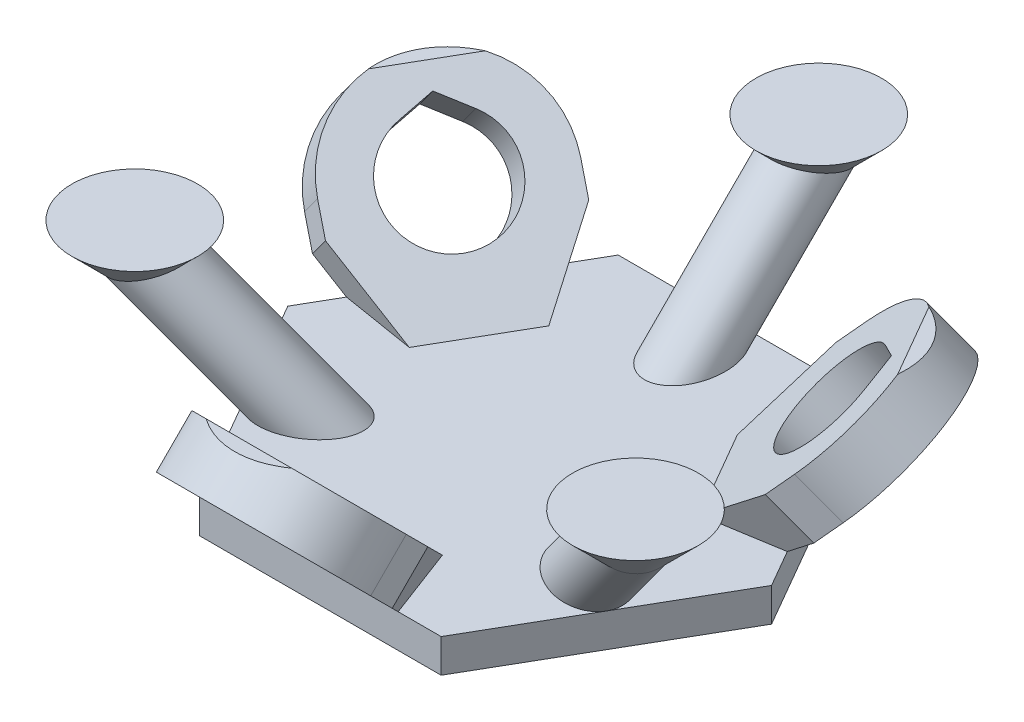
ISO-10303-21;
HEADER;
FILE_DESCRIPTION(('STEP AP214'),'2;1');
FILE_NAME('part.step','',(''),(''),'','','');
FILE_SCHEMA(('AUTOMOTIVE_DESIGN { 1 0 10303 214 1 1 1 1 }'));
ENDSEC;
DATA;
#1=APPLICATION_CONTEXT('core data for automotive mechanical design processes');
#2=APPLICATION_PROTOCOL_DEFINITION('international standard','automotive_design',2000,#1);
#3=PRODUCT_CONTEXT('',#1,'mechanical');
#4=PRODUCT('Part','Part','',(#3));
#5=PRODUCT_RELATED_PRODUCT_CATEGORY('part','',(#4));
#6=PRODUCT_DEFINITION_FORMATION('','',#4);
#7=PRODUCT_DEFINITION_CONTEXT('part definition',#1,'design');
#8=PRODUCT_DEFINITION('design','',#6,#7);
#9=PRODUCT_DEFINITION_SHAPE('','',#8);
#10=(LENGTH_UNIT() NAMED_UNIT(*) SI_UNIT(.MILLI.,.METRE.));
#11=(NAMED_UNIT(*) PLANE_ANGLE_UNIT() SI_UNIT($,.RADIAN.));
#12=(NAMED_UNIT(*) SI_UNIT($,.STERADIAN.) SOLID_ANGLE_UNIT());
#13=UNCERTAINTY_MEASURE_WITH_UNIT(LENGTH_MEASURE(1.E-05),#10,'distance_accuracy_value','');
#14=(GEOMETRIC_REPRESENTATION_CONTEXT(3) GLOBAL_UNCERTAINTY_ASSIGNED_CONTEXT((#13)) GLOBAL_UNIT_ASSIGNED_CONTEXT((#10,
#11,#12)) REPRESENTATION_CONTEXT('',''));
#15=CARTESIAN_POINT('',(0.,0.,0.));
#16=DIRECTION('',(0.,0.,1.));
#17=DIRECTION('',(1.,0.,0.));
#18=AXIS2_PLACEMENT_3D('',#15,#16,#17);
#19=CARTESIAN_POINT('',(0.,0.8,0.));
#20=DIRECTION('',(0.,1.,0.));
#21=DIRECTION('',(0.,0.,1.));
#22=AXIS2_PLACEMENT_3D('',#19,#20,#21);
#23=PLANE('',#22);
#24=DIRECTION('',(0.499999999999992,0.,0.866025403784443));
#25=VECTOR('',#24,1.);
#26=CARTESIAN_POINT('',(2.8604331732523,0.8,-1.65147186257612));
#27=LINE('',#26,#25);
#28=CARTESIAN_POINT('',(2.2510300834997,0.8,-2.70698897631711));
#29=VERTEX_POINT('',#28);
#30=CARTESIAN_POINT('',(3.46983626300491,0.8,-0.595954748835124));
#31=VERTEX_POINT('',#30);
#32=EDGE_CURVE('E12',#29,#31,#27,.T.);
#33=ORIENTED_EDGE('',*,*,#32,.F.);
#34=DIRECTION('',(0.633050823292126,0.,-0.774110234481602));
#35=VECTOR('',#34,1.);
#36=CARTESIAN_POINT('',(0.022359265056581,0.8,0.0182849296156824));
#37=LINE('',#36,#35);
#38=CARTESIAN_POINT('',(3.39967829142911,0.799999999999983,-4.11158446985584));
#39=VERTEX_POINT('',#38);
#40=EDGE_CURVE('E302',#29,#39,#37,.T.);
#41=ORIENTED_EDGE('',*,*,#40,.T.);
#42=DIRECTION('',(-0.5,0.,-0.866025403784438));
#43=VECTOR('',#42,1.);
#44=CARTESIAN_POINT('',(5.77350269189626,0.8,0.));
#45=LINE('',#44,#43);
#46=CARTESIAN_POINT('',(2.88675134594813,0.8,-5.));
#47=VERTEX_POINT('',#46);
#48=EDGE_CURVE('E492',#39,#47,#45,.T.);
#49=ORIENTED_EDGE('',*,*,#48,.T.);
#50=DIRECTION('',(-1.,0.,0.));
#51=VECTOR('',#50,1.);
#52=CARTESIAN_POINT('',(2.88675134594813,0.8,-5.));
#53=LINE('',#52,#51);
#54=CARTESIAN_POINT('',(0.,0.8,-5.00000000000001));
#55=VERTEX_POINT('',#54);
#56=EDGE_CURVE('E497',#47,#55,#53,.T.);
#57=ORIENTED_EDGE('',*,*,#56,.T.);
#58=CARTESIAN_POINT('',(0.,0.8,-3.86862915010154));
#59=DIRECTION('',(0.,1.,0.));
#60=DIRECTION('',(0.,0.,1.));
#61=AXIS2_PLACEMENT_3D('',#58,#59,#60);
#62=ELLIPSE('',#61,1.13137084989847,0.8);
#63=EDGE_CURVE('E485',#55,#55,#62,.F.);
#64=ORIENTED_EDGE('',*,*,#63,.T.);
#65=CARTESIAN_POINT('',(-2.88675134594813,0.8,-5.));
#66=VERTEX_POINT('',#65);
#67=EDGE_CURVE('E496',#55,#66,#53,.T.);
#68=ORIENTED_EDGE('',*,*,#67,.T.);
#69=DIRECTION('',(-0.5,0.,0.866025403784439));
#70=VECTOR('',#69,1.);
#71=CARTESIAN_POINT('',(-2.88675134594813,0.8,-5.));
#72=LINE('',#71,#70);
#73=CARTESIAN_POINT('',(-3.39967829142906,0.8,-4.11158446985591));
#74=VERTEX_POINT('',#73);
#75=EDGE_CURVE('E501',#66,#74,#72,.T.);
#76=ORIENTED_EDGE('',*,*,#75,.T.);
#77=DIRECTION('',(0.633050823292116,0.,0.774110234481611));
#78=VECTOR('',#77,1.);
#79=CARTESIAN_POINT('',(-0.0223592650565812,0.8,0.0182849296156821));
#80=LINE('',#79,#78);
#81=CARTESIAN_POINT('',(-2.25103008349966,0.8,-2.70698897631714));
#82=VERTEX_POINT('',#81);
#83=EDGE_CURVE('E379',#74,#82,#80,.T.);
#84=ORIENTED_EDGE('',*,*,#83,.T.);
#85=DIRECTION('',(0.500000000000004,0.,-0.866025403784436));
#86=VECTOR('',#85,1.);
#87=CARTESIAN_POINT('',(-2.86043317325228,0.8,-1.65147186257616));
#88=LINE('',#87,#86);
#89=CARTESIAN_POINT('',(-3.4698362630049,0.8,-0.595954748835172));
#90=VERTEX_POINT('',#89);
#91=EDGE_CURVE('E47',#90,#82,#88,.T.);
#92=ORIENTED_EDGE('',*,*,#91,.F.);
#93=DIRECTION('',(-0.98692454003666,0.,-0.161182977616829));
#94=VECTOR('',#93,1.);
#95=CARTESIAN_POINT('',(0.00465558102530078,0.8,-0.0285061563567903));
#96=LINE('',#95,#94);
#97=CARTESIAN_POINT('',(-5.2605757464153,0.799999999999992,-0.888415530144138));
#98=VERTEX_POINT('',#97);
#99=EDGE_CURVE('E381',#90,#98,#96,.T.);
#100=ORIENTED_EDGE('',*,*,#99,.T.);
#101=CARTESIAN_POINT('',(-5.77350269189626,0.8,0.));
#102=VERTEX_POINT('',#101);
#103=EDGE_CURVE('E500',#98,#102,#72,.T.);
#104=ORIENTED_EDGE('',*,*,#103,.T.);
#105=DIRECTION('',(0.5,0.,0.866025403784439));
#106=VECTOR('',#105,1.);
#107=CARTESIAN_POINT('',(-5.77350269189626,0.8,0.));
#108=LINE('',#107,#106);
#109=CARTESIAN_POINT('',(-4.33012701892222,0.79999999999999,2.49999999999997));
#110=VERTEX_POINT('',#109);
#111=EDGE_CURVE('E505',#102,#110,#108,.T.);
#112=ORIENTED_EDGE('',*,*,#111,.T.);
#113=CARTESIAN_POINT('',(-3.35033112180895,0.8,1.93431457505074));
#114=DIRECTION('',(0.,1.,0.));
#115=DIRECTION('',(0.866025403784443,0.,-0.499999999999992));
#116=AXIS2_PLACEMENT_3D('',#113,#114,#115);
#117=ELLIPSE('',#116,1.13137084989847,0.8);
#118=EDGE_CURVE('E393',#110,#110,#117,.F.);
#119=ORIENTED_EDGE('',*,*,#118,.T.);
#120=CARTESIAN_POINT('',(-2.88675134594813,0.8,5.));
#121=VERTEX_POINT('',#120);
#122=EDGE_CURVE('E504',#110,#121,#108,.T.);
#123=ORIENTED_EDGE('',*,*,#122,.T.);
#124=DIRECTION('',(1.,0.,0.));
#125=VECTOR('',#124,1.);
#126=CARTESIAN_POINT('',(-2.88675134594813,0.8,5.));
#127=LINE('',#126,#125);
#128=CARTESIAN_POINT('',(-1.86089745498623,0.8,5.));
#129=VERTEX_POINT('',#128);
#130=EDGE_CURVE('E509',#121,#129,#127,.T.);
#131=ORIENTED_EDGE('',*,*,#130,.T.);
#132=DIRECTION('',(0.353873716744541,0.,-0.935293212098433));
#133=VECTOR('',#132,1.);
#134=CARTESIAN_POINT('',(0.0270148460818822,0.8,0.0102212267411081));
#135=LINE('',#134,#133);
#136=CARTESIAN_POINT('',(-1.21880617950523,0.8,3.30294372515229));
#137=VERTEX_POINT('',#136);
#138=EDGE_CURVE('E471',#129,#137,#135,.T.);
#139=ORIENTED_EDGE('',*,*,#138,.T.);
#140=DIRECTION('',(-1.,0.,0.));
#141=VECTOR('',#140,1.);
#142=CARTESIAN_POINT('',(0.,0.8,3.30294372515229));
#143=LINE('',#142,#141);
#144=CARTESIAN_POINT('',(1.21880617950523,0.8,3.30294372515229));
#145=VERTEX_POINT('',#144);
#146=EDGE_CURVE('E542',#145,#137,#143,.T.);
#147=ORIENTED_EDGE('',*,*,#146,.F.);
#148=DIRECTION('',(0.353873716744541,0.,0.935293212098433));
#149=VECTOR('',#148,1.);
#150=CARTESIAN_POINT('',(-0.0270148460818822,0.8,0.0102212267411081));
#151=LINE('',#150,#149);
#152=CARTESIAN_POINT('',(1.86089745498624,0.800000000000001,5.));
#153=VERTEX_POINT('',#152);
#154=EDGE_CURVE('E473',#145,#153,#151,.T.);
#155=ORIENTED_EDGE('',*,*,#154,.T.);
#156=CARTESIAN_POINT('',(2.88675134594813,0.8,5.));
#157=VERTEX_POINT('',#156);
#158=EDGE_CURVE('E508',#153,#157,#127,.T.);
#159=ORIENTED_EDGE('',*,*,#158,.T.);
#160=DIRECTION('',(0.5,0.,-0.866025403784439));
#161=VECTOR('',#160,1.);
#162=CARTESIAN_POINT('',(2.88675134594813,0.8,5.));
#163=LINE('',#162,#161);
#164=CARTESIAN_POINT('',(4.33012701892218,0.799999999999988,2.50000000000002));
#165=VERTEX_POINT('',#164);
#166=EDGE_CURVE('E489',#157,#165,#163,.T.);
#167=ORIENTED_EDGE('',*,*,#166,.T.);
#168=CARTESIAN_POINT('',(3.35033112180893,0.8,1.93431457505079));
#169=DIRECTION('',(0.,1.,0.));
#170=DIRECTION('',(-0.866025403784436,0.,-0.500000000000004));
#171=AXIS2_PLACEMENT_3D('',#168,#169,#170);
#172=ELLIPSE('',#171,1.13137084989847,0.8);
#173=EDGE_CURVE('E402',#165,#165,#172,.F.);
#174=ORIENTED_EDGE('',*,*,#173,.T.);
#175=CARTESIAN_POINT('',(5.77350269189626,0.8,0.));
#176=VERTEX_POINT('',#175);
#177=EDGE_CURVE('E493',#165,#176,#163,.T.);
#178=ORIENTED_EDGE('',*,*,#177,.T.);
#179=CARTESIAN_POINT('',(5.26057574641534,0.8,-0.888415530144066));
#180=VERTEX_POINT('',#179);
#181=EDGE_CURVE('E494',#176,#180,#45,.T.);
#182=ORIENTED_EDGE('',*,*,#181,.T.);
#183=DIRECTION('',(-0.986924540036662,0.,0.161182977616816));
#184=VECTOR('',#183,1.);
#185=CARTESIAN_POINT('',(-0.00465558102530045,0.8,-0.0285061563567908));
#186=LINE('',#185,#184);
#187=EDGE_CURVE('E57',#180,#31,#186,.T.);
#188=ORIENTED_EDGE('',*,*,#187,.T.);
#189=EDGE_LOOP('',(#33,#41,#49,#57,#64,#68,#76,#84,#92,#100,#104,#112,#119,#123,#131,#139,#147,
#155,#159,#167,#174,#178,#182,#188));
#190=FACE_BOUND('',#189,.T.);
#191=ADVANCED_FACE('F39',(#190),#23,.T.);
#192=CARTESIAN_POINT('',(2.88675134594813,0.8,5.));
#193=DIRECTION('',(-0.866025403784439,0.,-0.5));
#194=DIRECTION('',(-0.5,0.,0.866025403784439));
#195=AXIS2_PLACEMENT_3D('',#192,#193,#194);
#196=PLANE('',#195);
#197=DIRECTION('',(0.5,0.,-0.866025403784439));
#198=VECTOR('',#197,1.);
#199=CARTESIAN_POINT('',(2.88675134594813,0.,5.));
#200=LINE('',#199,#198);
#201=CARTESIAN_POINT('',(2.88675134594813,0.,5.));
#202=VERTEX_POINT('',#201);
#203=CARTESIAN_POINT('',(5.77350269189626,0.,0.));
#204=VERTEX_POINT('',#203);
#205=EDGE_CURVE('E488',#202,#204,#200,.T.);
#206=ORIENTED_EDGE('',*,*,#205,.T.);
#207=DIRECTION('',(0.,-1.,0.));
#208=VECTOR('',#207,1.);
#209=CARTESIAN_POINT('',(5.77350269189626,0.8,0.));
#210=LINE('',#209,#208);
#211=EDGE_CURVE('E539',#176,#204,#210,.T.);
#212=ORIENTED_EDGE('',*,*,#211,.F.);
#213=ORIENTED_EDGE('',*,*,#177,.F.);
#214=ORIENTED_EDGE('',*,*,#166,.F.);
#215=DIRECTION('',(0.,-1.,0.));
#216=VECTOR('',#215,1.);
#217=CARTESIAN_POINT('',(2.88675134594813,0.8,5.));
#218=LINE('',#217,#216);
#219=EDGE_CURVE('E512',#157,#202,#218,.T.);
#220=ORIENTED_EDGE('',*,*,#219,.T.);
#221=EDGE_LOOP('',(#206,#212,#213,#214,#220));
#222=FACE_BOUND('',#221,.T.);
#223=ADVANCED_FACE('F41',(#222),#196,.F.);
#224=CARTESIAN_POINT('',(5.77350269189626,0.8,0.));
#225=DIRECTION('',(-0.866025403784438,0.,0.5));
#226=DIRECTION('',(0.5,0.,0.866025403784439));
#227=AXIS2_PLACEMENT_3D('',#224,#225,#226);
#228=PLANE('',#227);
#229=DIRECTION('',(-0.5,0.,-0.866025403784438));
#230=VECTOR('',#229,1.);
#231=CARTESIAN_POINT('',(5.77350269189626,0.,0.));
#232=LINE('',#231,#230);
#233=CARTESIAN_POINT('',(2.88675134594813,0.,-5.));
#234=VERTEX_POINT('',#233);
#235=EDGE_CURVE('E515',#204,#234,#232,.T.);
#236=ORIENTED_EDGE('',*,*,#235,.T.);
#237=DIRECTION('',(0.,-1.,0.));
#238=VECTOR('',#237,1.);
#239=CARTESIAN_POINT('',(2.88675134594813,0.8,-5.));
#240=LINE('',#239,#238);
#241=EDGE_CURVE('E536',#47,#234,#240,.T.);
#242=ORIENTED_EDGE('',*,*,#241,.F.);
#243=ORIENTED_EDGE('',*,*,#48,.F.);
#244=DIRECTION('',(-0.5,0.,-0.866025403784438));
#245=VECTOR('',#244,1.);
#246=CARTESIAN_POINT('',(5.77350269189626,0.800000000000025,0.));
#247=LINE('',#246,#245);
#248=EDGE_CURVE('E310',#180,#39,#247,.T.);
#249=ORIENTED_EDGE('',*,*,#248,.F.);
#250=ORIENTED_EDGE('',*,*,#181,.F.);
#251=ORIENTED_EDGE('',*,*,#211,.T.);
#252=EDGE_LOOP('',(#236,#242,#243,#249,#250,#251));
#253=FACE_BOUND('',#252,.T.);
#254=ADVANCED_FACE('F646',(#253),#228,.F.);
#255=CARTESIAN_POINT('',(2.88675134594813,0.8,-5.));
#256=DIRECTION('',(0.,0.,1.));
#257=DIRECTION('',(1.,0.,0.));
#258=AXIS2_PLACEMENT_3D('',#255,#256,#257);
#259=PLANE('',#258);
#260=DIRECTION('',(-1.,0.,0.));
#261=VECTOR('',#260,1.);
#262=CARTESIAN_POINT('',(2.88675134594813,0.,-5.));
#263=LINE('',#262,#261);
#264=CARTESIAN_POINT('',(-2.88675134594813,0.,-5.));
#265=VERTEX_POINT('',#264);
#266=EDGE_CURVE('E517',#234,#265,#263,.T.);
#267=ORIENTED_EDGE('',*,*,#266,.T.);
#268=DIRECTION('',(0.,-1.,0.));
#269=VECTOR('',#268,1.);
#270=CARTESIAN_POINT('',(-2.88675134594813,0.8,-5.));
#271=LINE('',#270,#269);
#272=EDGE_CURVE('E533',#66,#265,#271,.T.);
#273=ORIENTED_EDGE('',*,*,#272,.F.);
#274=ORIENTED_EDGE('',*,*,#67,.F.);
#275=ORIENTED_EDGE('',*,*,#56,.F.);
#276=ORIENTED_EDGE('',*,*,#241,.T.);
#277=EDGE_LOOP('',(#267,#273,#274,#275,#276));
#278=FACE_BOUND('',#277,.T.);
#279=ADVANCED_FACE('F585',(#278),#259,.F.);
#280=CARTESIAN_POINT('',(-2.88675134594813,0.8,-5.));
#281=DIRECTION('',(0.866025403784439,0.,0.5));
#282=DIRECTION('',(0.5,0.,-0.866025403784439));
#283=AXIS2_PLACEMENT_3D('',#280,#281,#282);
#284=PLANE('',#283);
#285=DIRECTION('',(-0.5,0.,0.866025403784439));
#286=VECTOR('',#285,1.);
#287=CARTESIAN_POINT('',(-2.88675134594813,0.,-5.));
#288=LINE('',#287,#286);
#289=CARTESIAN_POINT('',(-5.77350269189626,0.,0.));
#290=VERTEX_POINT('',#289);
#291=EDGE_CURVE('E519',#265,#290,#288,.T.);
#292=ORIENTED_EDGE('',*,*,#291,.T.);
#293=DIRECTION('',(0.,-1.,0.));
#294=VECTOR('',#293,1.);
#295=CARTESIAN_POINT('',(-5.77350269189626,0.8,0.));
#296=LINE('',#295,#294);
#297=EDGE_CURVE('E530',#102,#290,#296,.T.);
#298=ORIENTED_EDGE('',*,*,#297,.F.);
#299=ORIENTED_EDGE('',*,*,#103,.F.);
#300=DIRECTION('',(-0.5,0.,0.866025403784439));
#301=VECTOR('',#300,1.);
#302=CARTESIAN_POINT('',(-2.88675134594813,0.800000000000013,-5.));
#303=LINE('',#302,#301);
#304=EDGE_CURVE('E384',#74,#98,#303,.T.);
#305=ORIENTED_EDGE('',*,*,#304,.F.);
#306=ORIENTED_EDGE('',*,*,#75,.F.);
#307=ORIENTED_EDGE('',*,*,#272,.T.);
#308=EDGE_LOOP('',(#292,#298,#299,#305,#306,#307));
#309=FACE_BOUND('',#308,.T.);
#310=ADVANCED_FACE('F580',(#309),#284,.F.);
#311=CARTESIAN_POINT('',(-5.77350269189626,0.8,0.));
#312=DIRECTION('',(0.866025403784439,0.,-0.5));
#313=DIRECTION('',(-0.5,0.,-0.866025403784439));
#314=AXIS2_PLACEMENT_3D('',#311,#312,#313);
#315=PLANE('',#314);
#316=DIRECTION('',(0.5,0.,0.866025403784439));
#317=VECTOR('',#316,1.);
#318=CARTESIAN_POINT('',(-5.77350269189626,0.,0.));
#319=LINE('',#318,#317);
#320=CARTESIAN_POINT('',(-2.88675134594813,0.,5.));
#321=VERTEX_POINT('',#320);
#322=EDGE_CURVE('E521',#290,#321,#319,.T.);
#323=ORIENTED_EDGE('',*,*,#322,.T.);
#324=DIRECTION('',(0.,-1.,0.));
#325=VECTOR('',#324,1.);
#326=CARTESIAN_POINT('',(-2.88675134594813,0.8,5.));
#327=LINE('',#326,#325);
#328=EDGE_CURVE('E527',#121,#321,#327,.T.);
#329=ORIENTED_EDGE('',*,*,#328,.F.);
#330=ORIENTED_EDGE('',*,*,#122,.F.);
#331=ORIENTED_EDGE('',*,*,#111,.F.);
#332=ORIENTED_EDGE('',*,*,#297,.T.);
#333=EDGE_LOOP('',(#323,#329,#330,#331,#332));
#334=FACE_BOUND('',#333,.T.);
#335=ADVANCED_FACE('F595',(#334),#315,.F.);
#336=CARTESIAN_POINT('',(-2.88675134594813,0.8,5.));
#337=DIRECTION('',(0.,0.,-1.));
#338=DIRECTION('',(-1.,0.,0.));
#339=AXIS2_PLACEMENT_3D('',#336,#337,#338);
#340=PLANE('',#339);
#341=DIRECTION('',(1.,0.,0.));
#342=VECTOR('',#341,1.);
#343=CARTESIAN_POINT('',(-2.88675134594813,0.,5.));
#344=LINE('',#343,#342);
#345=EDGE_CURVE('E523',#321,#202,#344,.T.);
#346=ORIENTED_EDGE('',*,*,#345,.T.);
#347=ORIENTED_EDGE('',*,*,#219,.F.);
#348=ORIENTED_EDGE('',*,*,#158,.F.);
#349=DIRECTION('',(1.,0.,0.));
#350=VECTOR('',#349,1.);
#351=CARTESIAN_POINT('',(-2.88675134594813,0.799999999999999,5.));
#352=LINE('',#351,#350);
#353=EDGE_CURVE('E476',#129,#153,#352,.T.);
#354=ORIENTED_EDGE('',*,*,#353,.F.);
#355=ORIENTED_EDGE('',*,*,#130,.F.);
#356=ORIENTED_EDGE('',*,*,#328,.T.);
#357=EDGE_LOOP('',(#346,#347,#348,#354,#355,#356));
#358=FACE_BOUND('',#357,.T.);
#359=ADVANCED_FACE('F600',(#358),#340,.F.);
#360=CARTESIAN_POINT('',(0.,0.,0.));
#361=DIRECTION('',(0.,1.,0.));
#362=DIRECTION('',(0.,0.,1.));
#363=AXIS2_PLACEMENT_3D('',#360,#361,#362);
#364=PLANE('',#363);
#365=ORIENTED_EDGE('',*,*,#205,.F.);
#366=ORIENTED_EDGE('',*,*,#345,.F.);
#367=ORIENTED_EDGE('',*,*,#322,.F.);
#368=ORIENTED_EDGE('',*,*,#291,.F.);
#369=ORIENTED_EDGE('',*,*,#266,.F.);
#370=ORIENTED_EDGE('',*,*,#235,.F.);
#371=EDGE_LOOP('',(#365,#366,#367,#368,#369,#370));
#372=FACE_BOUND('',#371,.T.);
#373=ADVANCED_FACE('F591',(#372),#364,.F.);
#374=CARTESIAN_POINT('',(0.,5.07279220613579,-8.14142135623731));
#375=DIRECTION('',(0.,-0.707106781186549,0.707106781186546));
#376=DIRECTION('',(0.,-0.707106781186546,-0.707106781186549));
#377=AXIS2_PLACEMENT_3D('',#374,#375,#376);
#378=CYLINDRICAL_SURFACE('',#377,0.8);
#379=ORIENTED_EDGE('',*,*,#63,.F.);
#380=EDGE_LOOP('',(#379));
#381=FACE_BOUND('',#380,.T.);
#382=CARTESIAN_POINT('',(0.,3.54852813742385,-6.61715728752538));
#383=DIRECTION('',(0.,0.948683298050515,-0.316227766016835));
#384=DIRECTION('',(0.,0.316227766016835,0.948683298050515));
#385=AXIS2_PLACEMENT_3D('',#382,#383,#384);
#386=ELLIPSE('',#385,0.894427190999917,0.8);
#387=CARTESIAN_POINT('',(0.,3.83137084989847,-5.76862915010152));
#388=VERTEX_POINT('',#387);
#389=EDGE_CURVE('E482',#388,#388,#386,.F.);
#390=ORIENTED_EDGE('',*,*,#389,.T.);
#391=EDGE_LOOP('',(#390));
#392=FACE_BOUND('',#391,.T.);
#393=ADVANCED_FACE('F650',(#381,#392),#378,.T.);
#394=CARTESIAN_POINT('',(0.,4.2,-6.9));
#395=DIRECTION('',(0.,1.,0.));
#396=DIRECTION('',(0.,0.,1.));
#397=AXIS2_PLACEMENT_3D('',#394,#395,#396);
#398=CONICAL_SURFACE('',#397,1.5,0.78539816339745);
#399=CARTESIAN_POINT('',(0.,4.2,-6.9));
#400=DIRECTION('',(0.,1.,0.));
#401=DIRECTION('',(0.,0.,1.));
#402=AXIS2_PLACEMENT_3D('',#399,#400,#401);
#403=CIRCLE('',#402,1.5);
#404=CARTESIAN_POINT('',(0.,4.2,-5.4));
#405=VERTEX_POINT('',#404);
#406=EDGE_CURVE('E479',#405,#405,#403,.T.);
#407=ORIENTED_EDGE('',*,*,#406,.F.);
#408=EDGE_LOOP('',(#407));
#409=FACE_BOUND('',#408,.T.);
#410=ORIENTED_EDGE('',*,*,#389,.F.);
#411=EDGE_LOOP('',(#410));
#412=FACE_BOUND('',#411,.T.);
#413=ADVANCED_FACE('F1105',(#409,#412),#398,.T.);
#414=CARTESIAN_POINT('',(0.,4.2,0.));
#415=DIRECTION('',(0.,1.,0.));
#416=DIRECTION('',(0.,0.,1.));
#417=AXIS2_PLACEMENT_3D('',#414,#415,#416);
#418=PLANE('',#417);
#419=ORIENTED_EDGE('',*,*,#406,.T.);
#420=EDGE_LOOP('',(#419));
#421=FACE_BOUND('',#420,.T.);
#422=ADVANCED_FACE('F1095',(#421),#418,.T.);
#423=CARTESIAN_POINT('',(0.,1.89430393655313,6.09430393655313));
#424=DIRECTION('',(0.,0.707106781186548,-0.707106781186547));
#425=DIRECTION('',(0.,0.707106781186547,0.707106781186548));
#426=AXIS2_PLACEMENT_3D('',#423,#424,#425);
#427=PLANE('',#426);
#428=CARTESIAN_POINT('',(0.,1.89430393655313,6.09430393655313));
#429=DIRECTION('',(0.,0.707106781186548,-0.707106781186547));
#430=DIRECTION('',(0.,0.707106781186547,0.707106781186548));
#431=AXIS2_PLACEMENT_3D('',#428,#429,#430);
#432=CIRCLE('',#431,1.3);
#433=CARTESIAN_POINT('',(0.673962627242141,2.68036194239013,6.88036194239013));
#434=VERTEX_POINT('',#433);
#435=CARTESIAN_POINT('',(-0.673962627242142,2.68036194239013,6.88036194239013));
#436=VERTEX_POINT('',#435);
#437=EDGE_CURVE('E408',#434,#436,#432,.T.);
#438=ORIENTED_EDGE('',*,*,#437,.T.);
#439=DIRECTION('',(0.855118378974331,0.366587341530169,0.366587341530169));
#440=VECTOR('',#439,1.);
#441=CARTESIAN_POINT('',(0.,2.96928821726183,7.16928821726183));
#442=LINE('',#441,#440);
#443=CARTESIAN_POINT('',(0.,2.96928821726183,7.16928821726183));
#444=VERTEX_POINT('',#443);
#445=EDGE_CURVE('E420',#436,#444,#442,.T.);
#446=ORIENTED_EDGE('',*,*,#445,.T.);
#447=DIRECTION('',(0.855118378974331,-0.366587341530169,-0.366587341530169));
#448=VECTOR('',#447,1.);
#449=CARTESIAN_POINT('',(0.673962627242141,2.68036194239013,6.88036194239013));
#450=LINE('',#449,#448);
#451=EDGE_CURVE('E412',#444,#434,#450,.T.);
#452=ORIENTED_EDGE('',*,*,#451,.T.);
#453=EDGE_LOOP('',(#438,#446,#452));
#454=FACE_BOUND('',#453,.T.);
#455=DIRECTION('',(-0.471784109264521,0.623466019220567,0.623466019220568));
#456=VECTOR('',#455,1.);
#457=CARTESIAN_POINT('',(-2.3,1.38027710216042,5.58027710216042));
#458=LINE('',#457,#456);
#459=CARTESIAN_POINT('',(-2.3,1.38027710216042,5.58027710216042));
#460=VERTEX_POINT('',#459);
#461=EDGE_CURVE('E450',#129,#460,#458,.T.);
#462=ORIENTED_EDGE('',*,*,#461,.F.);
#463=ORIENTED_EDGE('',*,*,#353,.T.);
#464=DIRECTION('',(-0.471784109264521,-0.623466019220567,-0.623466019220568));
#465=VECTOR('',#464,1.);
#466=CARTESIAN_POINT('',(2.3,1.38027710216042,5.58027710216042));
#467=LINE('',#466,#465);
#468=CARTESIAN_POINT('',(2.3,1.38027710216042,5.58027710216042));
#469=VERTEX_POINT('',#468);
#470=EDGE_CURVE('E432',#469,#153,#467,.T.);
#471=ORIENTED_EDGE('',*,*,#470,.F.);
#472=DIRECTION('',(0.,-0.707106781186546,-0.707106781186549));
#473=VECTOR('',#472,1.);
#474=CARTESIAN_POINT('',(2.3,1.89430393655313,6.09430393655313));
#475=LINE('',#474,#473);
#476=CARTESIAN_POINT('',(2.3,1.89430393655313,6.09430393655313));
#477=VERTEX_POINT('',#476);
#478=EDGE_CURVE('E437',#477,#469,#475,.T.);
#479=ORIENTED_EDGE('',*,*,#478,.F.);
#480=CARTESIAN_POINT('',(0.,1.89430393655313,6.09430393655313));
#481=DIRECTION('',(0.,0.707106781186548,-0.707106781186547));
#482=DIRECTION('',(0.,0.707106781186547,0.707106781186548));
#483=AXIS2_PLACEMENT_3D('',#480,#481,#482);
#484=CIRCLE('',#483,2.3);
#485=CARTESIAN_POINT('',(-2.3,1.89430393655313,6.09430393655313));
#486=VERTEX_POINT('',#485);
#487=EDGE_CURVE('E454',#486,#477,#484,.T.);
#488=ORIENTED_EDGE('',*,*,#487,.F.);
#489=DIRECTION('',(0.,0.707106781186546,0.707106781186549));
#490=VECTOR('',#489,1.);
#491=CARTESIAN_POINT('',(-2.3,1.89430393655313,6.09430393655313));
#492=LINE('',#491,#490);
#493=EDGE_CURVE('E452',#460,#486,#492,.T.);
#494=ORIENTED_EDGE('',*,*,#493,.F.);
#495=EDGE_LOOP('',(#462,#463,#471,#479,#488,#494));
#496=FACE_BOUND('',#495,.T.);
#497=ADVANCED_FACE('F610',(#454,#496),#427,.F.);
#498=CARTESIAN_POINT('',(0.,2.74283207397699,5.24577579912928));
#499=DIRECTION('',(0.,0.707106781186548,-0.707106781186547));
#500=DIRECTION('',(0.,0.707106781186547,0.707106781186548));
#501=AXIS2_PLACEMENT_3D('',#498,#499,#500);
#502=PLANE('',#501);
#503=DIRECTION('',(0.855118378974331,0.366587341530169,0.366587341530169));
#504=VECTOR('',#503,1.);
#505=CARTESIAN_POINT('',(0.,3.81781635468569,6.32076007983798));
#506=LINE('',#505,#504);
#507=CARTESIAN_POINT('',(-0.673962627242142,3.52889007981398,6.03183380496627));
#508=VERTEX_POINT('',#507);
#509=CARTESIAN_POINT('',(0.,3.81781635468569,6.32076007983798));
#510=VERTEX_POINT('',#509);
#511=EDGE_CURVE('E411',#508,#510,#506,.T.);
#512=ORIENTED_EDGE('',*,*,#511,.F.);
#513=CARTESIAN_POINT('',(0.,2.74283207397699,5.24577579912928));
#514=DIRECTION('',(0.,0.707106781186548,-0.707106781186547));
#515=DIRECTION('',(0.,0.707106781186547,0.707106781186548));
#516=AXIS2_PLACEMENT_3D('',#513,#514,#515);
#517=CIRCLE('',#516,1.3);
#518=CARTESIAN_POINT('',(0.673962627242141,3.52889007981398,6.03183380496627));
#519=VERTEX_POINT('',#518);
#520=EDGE_CURVE('E409',#519,#508,#517,.T.);
#521=ORIENTED_EDGE('',*,*,#520,.F.);
#522=DIRECTION('',(0.855118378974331,-0.366587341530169,-0.366587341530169));
#523=VECTOR('',#522,1.);
#524=CARTESIAN_POINT('',(0.673962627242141,3.52889007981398,6.03183380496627));
#525=LINE('',#524,#523);
#526=EDGE_CURVE('E415',#510,#519,#525,.T.);
#527=ORIENTED_EDGE('',*,*,#526,.F.);
#528=EDGE_LOOP('',(#512,#521,#527));
#529=FACE_BOUND('',#528,.T.);
#530=DIRECTION('',(-0.471784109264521,-0.623466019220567,-0.623466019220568));
#531=VECTOR('',#530,1.);
#532=CARTESIAN_POINT('',(2.3,2.22880523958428,4.73174896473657));
#533=LINE('',#532,#531);
#534=CARTESIAN_POINT('',(2.3,2.22880523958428,4.73174896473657));
#535=VERTEX_POINT('',#534);
#536=EDGE_CURVE('E433',#535,#145,#533,.T.);
#537=ORIENTED_EDGE('',*,*,#536,.T.);
#538=ORIENTED_EDGE('',*,*,#146,.T.);
#539=DIRECTION('',(-0.471784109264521,0.623466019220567,0.623466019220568));
#540=VECTOR('',#539,1.);
#541=CARTESIAN_POINT('',(-2.3,2.22880523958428,4.73174896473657));
#542=LINE('',#541,#540);
#543=CARTESIAN_POINT('',(-2.3,2.22880523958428,4.73174896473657));
#544=VERTEX_POINT('',#543);
#545=EDGE_CURVE('E436',#137,#544,#542,.T.);
#546=ORIENTED_EDGE('',*,*,#545,.T.);
#547=DIRECTION('',(0.,0.707106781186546,0.707106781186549));
#548=VECTOR('',#547,1.);
#549=CARTESIAN_POINT('',(-2.3,2.74283207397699,5.24577579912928));
#550=LINE('',#549,#548);
#551=CARTESIAN_POINT('',(-2.3,2.74283207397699,5.24577579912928));
#552=VERTEX_POINT('',#551);
#553=EDGE_CURVE('E439',#544,#552,#550,.T.);
#554=ORIENTED_EDGE('',*,*,#553,.T.);
#555=CARTESIAN_POINT('',(0.,2.74283207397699,5.24577579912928));
#556=DIRECTION('',(0.,0.707106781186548,-0.707106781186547));
#557=DIRECTION('',(0.,0.707106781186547,0.707106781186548));
#558=AXIS2_PLACEMENT_3D('',#555,#556,#557);
#559=CIRCLE('',#558,2.3);
#560=CARTESIAN_POINT('',(-1.02143197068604,4.2,6.70294372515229));
#561=VERTEX_POINT('',#560);
#562=EDGE_CURVE('E442',#552,#561,#559,.T.);
#563=ORIENTED_EDGE('',*,*,#562,.T.);
#564=DIRECTION('',(1.,0.,0.));
#565=VECTOR('',#564,1.);
#566=CARTESIAN_POINT('',(0.,4.2,6.70294372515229));
#567=LINE('',#566,#565);
#568=CARTESIAN_POINT('',(1.02143197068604,4.2,6.70294372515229));
#569=VERTEX_POINT('',#568);
#570=EDGE_CURVE('E405',#561,#569,#567,.T.);
#571=ORIENTED_EDGE('',*,*,#570,.T.);
#572=CARTESIAN_POINT('',(2.3,2.74283207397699,5.24577579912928));
#573=VERTEX_POINT('',#572);
#574=EDGE_CURVE('E441',#569,#573,#559,.T.);
#575=ORIENTED_EDGE('',*,*,#574,.T.);
#576=DIRECTION('',(0.,-0.707106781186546,-0.707106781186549));
#577=VECTOR('',#576,1.);
#578=CARTESIAN_POINT('',(2.3,2.74283207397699,5.24577579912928));
#579=LINE('',#578,#577);
#580=EDGE_CURVE('E445',#573,#535,#579,.T.);
#581=ORIENTED_EDGE('',*,*,#580,.T.);
#582=EDGE_LOOP('',(#537,#538,#546,#554,#563,#571,#575,#581));
#583=FACE_BOUND('',#582,.T.);
#584=ADVANCED_FACE('F624',(#529,#583),#502,.T.);
#585=CARTESIAN_POINT('',(0.,2.74283207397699,5.24577579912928));
#586=DIRECTION('',(0.,-0.707106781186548,0.707106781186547));
#587=DIRECTION('',(0.,-0.707106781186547,-0.707106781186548));
#588=AXIS2_PLACEMENT_3D('',#585,#586,#587);
#589=CYLINDRICAL_SURFACE('',#588,2.3);
#590=CARTESIAN_POINT('',(0.,4.2,3.78860787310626));
#591=DIRECTION('',(0.,1.,0.));
#592=DIRECTION('',(0.,0.,1.));
#593=AXIS2_PLACEMENT_3D('',#590,#591,#592);
#594=ELLIPSE('',#593,3.25269119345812,2.3);
#595=EDGE_CURVE('E468',#561,#569,#594,.T.);
#596=ORIENTED_EDGE('',*,*,#595,.F.);
#597=ORIENTED_EDGE('',*,*,#562,.F.);
#598=DIRECTION('',(0.,-0.707106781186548,0.707106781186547));
#599=VECTOR('',#598,1.);
#600=CARTESIAN_POINT('',(-2.3,2.74283207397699,5.24577579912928));
#601=LINE('',#600,#599);
#602=EDGE_CURVE('E462',#552,#486,#601,.T.);
#603=ORIENTED_EDGE('',*,*,#602,.T.);
#604=ORIENTED_EDGE('',*,*,#487,.T.);
#605=DIRECTION('',(0.,-0.707106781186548,0.707106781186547));
#606=VECTOR('',#605,1.);
#607=CARTESIAN_POINT('',(2.3,2.74283207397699,5.24577579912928));
#608=LINE('',#607,#606);
#609=EDGE_CURVE('E459',#573,#477,#608,.T.);
#610=ORIENTED_EDGE('',*,*,#609,.F.);
#611=ORIENTED_EDGE('',*,*,#574,.F.);
#612=EDGE_LOOP('',(#596,#597,#603,#604,#610,#611));
#613=FACE_BOUND('',#612,.T.);
#614=ADVANCED_FACE('F620',(#613),#589,.T.);
#615=CARTESIAN_POINT('',(2.3,2.22880523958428,4.73174896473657));
#616=DIRECTION('',(-0.881714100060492,0.333601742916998,0.333601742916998));
#617=DIRECTION('',(0.353873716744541,0.,0.935293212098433));
#618=AXIS2_PLACEMENT_3D('',#615,#616,#617);
#619=PLANE('',#618);
#620=ORIENTED_EDGE('',*,*,#154,.F.);
#621=ORIENTED_EDGE('',*,*,#536,.F.);
#622=DIRECTION('',(0.,-0.707106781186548,0.707106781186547));
#623=VECTOR('',#622,1.);
#624=CARTESIAN_POINT('',(2.3,2.22880523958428,4.73174896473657));
#625=LINE('',#624,#623);
#626=EDGE_CURVE('E447',#535,#469,#625,.T.);
#627=ORIENTED_EDGE('',*,*,#626,.T.);
#628=ORIENTED_EDGE('',*,*,#470,.T.);
#629=EDGE_LOOP('',(#620,#621,#627,#628));
#630=FACE_BOUND('',#629,.T.);
#631=ADVANCED_FACE('F1060',(#630),#619,.F.);
#632=CARTESIAN_POINT('',(-2.3,2.22880523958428,4.73174896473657));
#633=DIRECTION('',(0.881714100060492,0.333601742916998,0.333601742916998));
#634=DIRECTION('',(0.353873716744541,0.,-0.935293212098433));
#635=AXIS2_PLACEMENT_3D('',#632,#633,#634);
#636=PLANE('',#635);
#637=ORIENTED_EDGE('',*,*,#138,.F.);
#638=ORIENTED_EDGE('',*,*,#461,.T.);
#639=DIRECTION('',(0.,-0.707106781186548,0.707106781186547));
#640=VECTOR('',#639,1.);
#641=CARTESIAN_POINT('',(-2.3,2.22880523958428,4.73174896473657));
#642=LINE('',#641,#640);
#643=EDGE_CURVE('E465',#544,#460,#642,.T.);
#644=ORIENTED_EDGE('',*,*,#643,.F.);
#645=ORIENTED_EDGE('',*,*,#545,.F.);
#646=EDGE_LOOP('',(#637,#638,#644,#645));
#647=FACE_BOUND('',#646,.T.);
#648=ADVANCED_FACE('F606',(#647),#636,.F.);
#649=CARTESIAN_POINT('',(-2.3,2.74283207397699,5.24577579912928));
#650=DIRECTION('',(1.,0.,0.));
#651=DIRECTION('',(0.,0.,-1.));
#652=AXIS2_PLACEMENT_3D('',#649,#650,#651);
#653=PLANE('',#652);
#654=ORIENTED_EDGE('',*,*,#493,.T.);
#655=ORIENTED_EDGE('',*,*,#602,.F.);
#656=ORIENTED_EDGE('',*,*,#553,.F.);
#657=ORIENTED_EDGE('',*,*,#643,.T.);
#658=EDGE_LOOP('',(#654,#655,#656,#657));
#659=FACE_BOUND('',#658,.T.);
#660=ADVANCED_FACE('F616',(#659),#653,.F.);
#661=CARTESIAN_POINT('',(2.3,2.74283207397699,5.24577579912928));
#662=DIRECTION('',(-1.,0.,0.));
#663=DIRECTION('',(0.,0.,1.));
#664=AXIS2_PLACEMENT_3D('',#661,#662,#663);
#665=PLANE('',#664);
#666=ORIENTED_EDGE('',*,*,#478,.T.);
#667=ORIENTED_EDGE('',*,*,#626,.F.);
#668=ORIENTED_EDGE('',*,*,#580,.F.);
#669=ORIENTED_EDGE('',*,*,#609,.T.);
#670=EDGE_LOOP('',(#666,#667,#668,#669));
#671=FACE_BOUND('',#670,.T.);
#672=ADVANCED_FACE('F1033',(#671),#665,.F.);
#673=CARTESIAN_POINT('',(0.,2.74283207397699,5.24577579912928));
#674=DIRECTION('',(0.,-0.707106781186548,0.707106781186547));
#675=DIRECTION('',(0.,-0.707106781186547,-0.707106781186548));
#676=AXIS2_PLACEMENT_3D('',#673,#674,#675);
#677=CYLINDRICAL_SURFACE('',#676,1.3);
#678=ORIENTED_EDGE('',*,*,#437,.F.);
#679=DIRECTION('',(0.,-0.707106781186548,0.707106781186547));
#680=VECTOR('',#679,1.);
#681=CARTESIAN_POINT('',(0.673962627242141,3.52889007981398,6.03183380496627));
#682=LINE('',#681,#680);
#683=EDGE_CURVE('E417',#519,#434,#682,.T.);
#684=ORIENTED_EDGE('',*,*,#683,.F.);
#685=ORIENTED_EDGE('',*,*,#520,.T.);
#686=DIRECTION('',(0.,-0.707106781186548,0.707106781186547));
#687=VECTOR('',#686,1.);
#688=CARTESIAN_POINT('',(-0.673962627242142,3.52889007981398,6.03183380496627));
#689=LINE('',#688,#687);
#690=EDGE_CURVE('E429',#508,#436,#689,.T.);
#691=ORIENTED_EDGE('',*,*,#690,.T.);
#692=EDGE_LOOP('',(#678,#684,#685,#691));
#693=FACE_BOUND('',#692,.T.);
#694=ADVANCED_FACE('F1023',(#693),#677,.F.);
#695=CARTESIAN_POINT('',(0.,3.81781635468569,6.32076007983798));
#696=DIRECTION('',(0.518432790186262,-0.604660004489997,-0.604660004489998));
#697=DIRECTION('',(0.,0.707106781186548,-0.707106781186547));
#698=AXIS2_PLACEMENT_3D('',#695,#696,#697);
#699=PLANE('',#698);
#700=ORIENTED_EDGE('',*,*,#445,.F.);
#701=ORIENTED_EDGE('',*,*,#690,.F.);
#702=ORIENTED_EDGE('',*,*,#511,.T.);
#703=DIRECTION('',(0.,-0.707106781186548,0.707106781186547));
#704=VECTOR('',#703,1.);
#705=CARTESIAN_POINT('',(0.,3.81781635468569,6.32076007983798));
#706=LINE('',#705,#704);
#707=EDGE_CURVE('E427',#510,#444,#706,.T.);
#708=ORIENTED_EDGE('',*,*,#707,.T.);
#709=EDGE_LOOP('',(#700,#701,#702,#708));
#710=FACE_BOUND('',#709,.T.);
#711=ADVANCED_FACE('F638',(#710),#699,.T.);
#712=CARTESIAN_POINT('',(0.673962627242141,3.52889007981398,6.03183380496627));
#713=DIRECTION('',(-0.518432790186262,-0.604660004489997,-0.604660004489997));
#714=DIRECTION('',(0.,0.707106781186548,-0.707106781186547));
#715=AXIS2_PLACEMENT_3D('',#712,#713,#714);
#716=PLANE('',#715);
#717=ORIENTED_EDGE('',*,*,#451,.F.);
#718=ORIENTED_EDGE('',*,*,#707,.F.);
#719=ORIENTED_EDGE('',*,*,#526,.T.);
#720=ORIENTED_EDGE('',*,*,#683,.T.);
#721=EDGE_LOOP('',(#717,#718,#719,#720));
#722=FACE_BOUND('',#721,.T.);
#723=ADVANCED_FACE('F629',(#722),#716,.T.);
#724=CARTESIAN_POINT('',(0.,4.2,0.));
#725=DIRECTION('',(0.,1.,0.));
#726=DIRECTION('',(0.,0.,1.));
#727=AXIS2_PLACEMENT_3D('',#724,#725,#726);
#728=PLANE('',#727);
#729=ORIENTED_EDGE('',*,*,#570,.F.);
#730=ORIENTED_EDGE('',*,*,#595,.T.);
#731=EDGE_LOOP('',(#729,#730));
#732=FACE_BOUND('',#731,.T.);
#733=ADVANCED_FACE('F626',(#732),#728,.T.);
#734=CARTESIAN_POINT('',(7.05067771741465,5.07279220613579,4.07071067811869));
#735=DIRECTION('',(-0.612372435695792,-0.707106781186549,-0.353553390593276));
#736=DIRECTION('',(0.612372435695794,-0.707106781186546,0.353553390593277));
#737=AXIS2_PLACEMENT_3D('',#734,#735,#736);
#738=CYLINDRICAL_SURFACE('',#737,0.8);
#739=ORIENTED_EDGE('',*,*,#173,.F.);
#740=EDGE_LOOP('',(#739));
#741=FACE_BOUND('',#740,.T.);
#742=CARTESIAN_POINT('',(5.7306263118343,3.54852813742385,3.30857864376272));
#743=DIRECTION('',(0.27386127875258,0.948683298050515,0.158113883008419));
#744=DIRECTION('',(-0.821583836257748,0.316227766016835,-0.474341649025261));
#745=AXIS2_PLACEMENT_3D('',#742,#743,#744);
#746=ELLIPSE('',#745,0.894427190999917,0.8);
#747=CARTESIAN_POINT('',(4.99577938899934,3.83137084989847,2.88431457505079));
#748=VERTEX_POINT('',#747);
#749=EDGE_CURVE('E399',#748,#748,#746,.F.);
#750=ORIENTED_EDGE('',*,*,#749,.T.);
#751=EDGE_LOOP('',(#750));
#752=FACE_BOUND('',#751,.T.);
#753=ADVANCED_FACE('F628',(#741,#752),#738,.T.);
#754=CARTESIAN_POINT('',(5.97557528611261,4.2,3.45000000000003));
#755=DIRECTION('',(0.,1.,0.));
#756=DIRECTION('',(-0.866025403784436,0.,-0.500000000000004));
#757=AXIS2_PLACEMENT_3D('',#754,#755,#756);
#758=CONICAL_SURFACE('',#757,1.5,0.78539816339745);
#759=CARTESIAN_POINT('',(5.97557528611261,4.2,3.45000000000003));
#760=DIRECTION('',(0.,1.,0.));
#761=DIRECTION('',(-0.866025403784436,0.,-0.500000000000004));
#762=AXIS2_PLACEMENT_3D('',#759,#760,#761);
#763=CIRCLE('',#762,1.5);
#764=CARTESIAN_POINT('',(4.67653718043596,4.2,2.70000000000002));
#765=VERTEX_POINT('',#764);
#766=EDGE_CURVE('E396',#765,#765,#763,.T.);
#767=ORIENTED_EDGE('',*,*,#766,.F.);
#768=EDGE_LOOP('',(#767));
#769=FACE_BOUND('',#768,.T.);
#770=ORIENTED_EDGE('',*,*,#749,.F.);
#771=EDGE_LOOP('',(#770));
#772=FACE_BOUND('',#771,.T.);
#773=ADVANCED_FACE('F635',(#769,#772),#758,.T.);
#774=CARTESIAN_POINT('',(0.,4.2,0.));
#775=DIRECTION('',(0.,1.,0.));
#776=DIRECTION('',(-0.866025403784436,0.,-0.500000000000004));
#777=AXIS2_PLACEMENT_3D('',#774,#775,#776);
#778=PLANE('',#777);
#779=ORIENTED_EDGE('',*,*,#766,.T.);
#780=EDGE_LOOP('',(#779));
#781=FACE_BOUND('',#780,.T.);
#782=ADVANCED_FACE('F770',(#781),#778,.T.);
#783=CARTESIAN_POINT('',(-7.05067771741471,5.07279220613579,4.07071067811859));
#784=DIRECTION('',(0.612372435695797,-0.707106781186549,-0.353553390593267));
#785=DIRECTION('',(-0.612372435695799,-0.707106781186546,0.353553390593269));
#786=AXIS2_PLACEMENT_3D('',#783,#784,#785);
#787=CYLINDRICAL_SURFACE('',#786,0.8);
#788=ORIENTED_EDGE('',*,*,#118,.F.);
#789=EDGE_LOOP('',(#788));
#790=FACE_BOUND('',#789,.T.);
#791=CARTESIAN_POINT('',(-5.73062631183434,3.54852813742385,3.30857864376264));
#792=DIRECTION('',(-0.273861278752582,0.948683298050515,0.158113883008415));
#793=DIRECTION('',(0.821583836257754,0.316227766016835,-0.47434164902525));
#794=AXIS2_PLACEMENT_3D('',#791,#792,#793);
#795=ELLIPSE('',#794,0.894427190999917,0.8);
#796=CARTESIAN_POINT('',(-4.99577938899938,3.83137084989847,2.88431457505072));
#797=VERTEX_POINT('',#796);
#798=EDGE_CURVE('E390',#797,#797,#795,.F.);
#799=ORIENTED_EDGE('',*,*,#798,.T.);
#800=EDGE_LOOP('',(#799));
#801=FACE_BOUND('',#800,.T.);
#802=ADVANCED_FACE('F763',(#790,#801),#787,.T.);
#803=CARTESIAN_POINT('',(-5.97557528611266,4.2,3.44999999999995));
#804=DIRECTION('',(0.,1.,0.));
#805=DIRECTION('',(0.866025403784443,0.,-0.499999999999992));
#806=AXIS2_PLACEMENT_3D('',#803,#804,#805);
#807=CONICAL_SURFACE('',#806,1.5,0.78539816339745);
#808=CARTESIAN_POINT('',(-5.97557528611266,4.2,3.44999999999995));
#809=DIRECTION('',(0.,1.,0.));
#810=DIRECTION('',(0.866025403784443,0.,-0.499999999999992));
#811=AXIS2_PLACEMENT_3D('',#808,#809,#810);
#812=CIRCLE('',#811,1.5);
#813=CARTESIAN_POINT('',(-4.67653718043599,4.2,2.69999999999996));
#814=VERTEX_POINT('',#813);
#815=EDGE_CURVE('E387',#814,#814,#812,.T.);
#816=ORIENTED_EDGE('',*,*,#815,.F.);
#817=EDGE_LOOP('',(#816));
#818=FACE_BOUND('',#817,.T.);
#819=ORIENTED_EDGE('',*,*,#798,.F.);
#820=EDGE_LOOP('',(#819));
#821=FACE_BOUND('',#820,.T.);
#822=ADVANCED_FACE('F760',(#818,#821),#807,.T.);
#823=CARTESIAN_POINT('',(0.,4.2,0.));
#824=DIRECTION('',(0.,1.,0.));
#825=DIRECTION('',(0.866025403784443,0.,-0.499999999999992));
#826=AXIS2_PLACEMENT_3D('',#823,#824,#825);
#827=PLANE('',#826);
#828=ORIENTED_EDGE('',*,*,#815,.T.);
#829=EDGE_LOOP('',(#828));
#830=FACE_BOUND('',#829,.T.);
#831=ADVANCED_FACE('F748',(#830),#827,.T.);
#832=CARTESIAN_POINT('',(-5.27782202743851,1.89430393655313,-3.04715196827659));
#833=DIRECTION('',(0.612372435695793,0.707106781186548,0.353553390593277));
#834=DIRECTION('',(-0.612372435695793,0.707106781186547,-0.353553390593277));
#835=AXIS2_PLACEMENT_3D('',#832,#833,#834);
#836=PLANE('',#835);
#837=CARTESIAN_POINT('',(-5.27782202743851,1.89430393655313,-3.04715196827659));
#838=DIRECTION('',(0.612372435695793,0.707106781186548,0.353553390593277));
#839=DIRECTION('',(-0.612372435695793,0.707106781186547,-0.353553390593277));
#840=AXIS2_PLACEMENT_3D('',#837,#838,#839);
#841=CIRCLE('',#840,1.3);
#842=CARTESIAN_POINT('',(-6.29554954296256,2.68036194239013,-2.8565122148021));
#843=VERTEX_POINT('',#842);
#844=CARTESIAN_POINT('',(-5.62158691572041,2.68036194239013,-4.02384972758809));
#845=VERTEX_POINT('',#844);
#846=EDGE_CURVE('E316',#843,#845,#841,.T.);
#847=ORIENTED_EDGE('',*,*,#846,.T.);
#848=DIRECTION('',(-0.745033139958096,0.366587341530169,0.557260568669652));
#849=VECTOR('',#848,1.);
#850=CARTESIAN_POINT('',(-6.20878572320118,2.96928821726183,-3.58464410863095));
#851=LINE('',#850,#849);
#852=CARTESIAN_POINT('',(-6.20878572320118,2.96928821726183,-3.58464410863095));
#853=VERTEX_POINT('',#852);
#854=EDGE_CURVE('E328',#845,#853,#851,.T.);
#855=ORIENTED_EDGE('',*,*,#854,.T.);
#856=DIRECTION('',(-0.110085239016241,-0.366587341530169,0.923847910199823));
#857=VECTOR('',#856,1.);
#858=CARTESIAN_POINT('',(-6.29554954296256,2.68036194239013,-2.8565122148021));
#859=LINE('',#858,#857);
#860=EDGE_CURVE('E320',#853,#843,#859,.T.);
#861=ORIENTED_EDGE('',*,*,#860,.T.);
#862=EDGE_LOOP('',(#847,#855,#861));
#863=FACE_BOUND('',#862,.T.);
#864=DIRECTION('',(-0.304045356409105,0.623466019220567,-0.720310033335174));
#865=VECTOR('',#864,1.);
#866=CARTESIAN_POINT('',(-3.68266173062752,1.38027710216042,-4.78199697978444));
#867=LINE('',#866,#865);
#868=CARTESIAN_POINT('',(-3.68266173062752,1.38027710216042,-4.78199697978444));
#869=VERTEX_POINT('',#868);
#870=EDGE_CURVE('E358',#74,#869,#867,.T.);
#871=ORIENTED_EDGE('',*,*,#870,.F.);
#872=ORIENTED_EDGE('',*,*,#304,.T.);
#873=DIRECTION('',(0.77582946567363,-0.623466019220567,-0.0968440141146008));
#874=VECTOR('',#873,1.);
#875=CARTESIAN_POINT('',(-5.98266173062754,1.38027710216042,-0.798280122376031));
#876=LINE('',#875,#874);
#877=CARTESIAN_POINT('',(-5.98266173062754,1.38027710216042,-0.798280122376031));
#878=VERTEX_POINT('',#877);
#879=EDGE_CURVE('E340',#878,#98,#876,.T.);
#880=ORIENTED_EDGE('',*,*,#879,.F.);
#881=DIRECTION('',(0.612372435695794,-0.707106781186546,0.353553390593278));
#882=VECTOR('',#881,1.);
#883=CARTESIAN_POINT('',(-6.42782202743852,1.89430393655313,-1.05529353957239));
#884=LINE('',#883,#882);
#885=CARTESIAN_POINT('',(-6.42782202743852,1.89430393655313,-1.05529353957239));
#886=VERTEX_POINT('',#885);
#887=EDGE_CURVE('E345',#886,#878,#884,.T.);
#888=ORIENTED_EDGE('',*,*,#887,.F.);
#889=CARTESIAN_POINT('',(-5.27782202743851,1.89430393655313,-3.04715196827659));
#890=DIRECTION('',(0.612372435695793,0.707106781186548,0.353553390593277));
#891=DIRECTION('',(-0.612372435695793,0.707106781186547,-0.353553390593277));
#892=AXIS2_PLACEMENT_3D('',#889,#890,#891);
#893=CIRCLE('',#892,2.3);
#894=CARTESIAN_POINT('',(-4.1278220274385,1.89430393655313,-5.0390103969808));
#895=VERTEX_POINT('',#894);
#896=EDGE_CURVE('E362',#895,#886,#893,.T.);
#897=ORIENTED_EDGE('',*,*,#896,.F.);
#898=DIRECTION('',(-0.612372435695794,0.707106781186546,-0.353553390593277));
#899=VECTOR('',#898,1.);
#900=CARTESIAN_POINT('',(-4.1278220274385,1.89430393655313,-5.0390103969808));
#901=LINE('',#900,#899);
#902=EDGE_CURVE('E360',#869,#895,#901,.T.);
#903=ORIENTED_EDGE('',*,*,#902,.F.);
#904=EDGE_LOOP('',(#871,#872,#880,#888,#897,#903));
#905=FACE_BOUND('',#904,.T.);
#906=ADVANCED_FACE('F577',(#863,#905),#836,.F.);
#907=CARTESIAN_POINT('',(-4.54297510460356,2.74283207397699,-2.62288789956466));
#908=DIRECTION('',(0.612372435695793,0.707106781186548,0.353553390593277));
#909=DIRECTION('',(-0.612372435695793,0.707106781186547,-0.353553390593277));
#910=AXIS2_PLACEMENT_3D('',#907,#908,#909);
#911=PLANE('',#910);
#912=DIRECTION('',(-0.745033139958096,0.366587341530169,0.557260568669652));
#913=VECTOR('',#912,1.);
#914=CARTESIAN_POINT('',(-5.47393880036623,3.81781635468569,-3.16038003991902));
#915=LINE('',#914,#913);
#916=CARTESIAN_POINT('',(-4.88673999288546,3.52889007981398,-3.59958565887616));
#917=VERTEX_POINT('',#916);
#918=CARTESIAN_POINT('',(-5.47393880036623,3.81781635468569,-3.16038003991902));
#919=VERTEX_POINT('',#918);
#920=EDGE_CURVE('E319',#917,#919,#915,.T.);
#921=ORIENTED_EDGE('',*,*,#920,.F.);
#922=CARTESIAN_POINT('',(-4.54297510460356,2.74283207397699,-2.62288789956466));
#923=DIRECTION('',(0.612372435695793,0.707106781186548,0.353553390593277));
#924=DIRECTION('',(-0.612372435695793,0.707106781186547,-0.353553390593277));
#925=AXIS2_PLACEMENT_3D('',#922,#923,#924);
#926=CIRCLE('',#925,1.3);
#927=CARTESIAN_POINT('',(-5.5607026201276,3.52889007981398,-2.43224814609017));
#928=VERTEX_POINT('',#927);
#929=EDGE_CURVE('E317',#928,#917,#926,.T.);
#930=ORIENTED_EDGE('',*,*,#929,.F.);
#931=DIRECTION('',(-0.110085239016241,-0.366587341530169,0.923847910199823));
#932=VECTOR('',#931,1.);
#933=CARTESIAN_POINT('',(-5.5607026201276,3.52889007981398,-2.43224814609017));
#934=LINE('',#933,#932);
#935=EDGE_CURVE('E323',#919,#928,#934,.T.);
#936=ORIENTED_EDGE('',*,*,#935,.F.);
#937=EDGE_LOOP('',(#921,#930,#936));
#938=FACE_BOUND('',#937,.T.);
#939=DIRECTION('',(0.77582946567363,-0.623466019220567,-0.0968440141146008));
#940=VECTOR('',#939,1.);
#941=CARTESIAN_POINT('',(-5.24781480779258,2.22880523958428,-0.374016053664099));
#942=LINE('',#941,#940);
#943=CARTESIAN_POINT('',(-5.24781480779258,2.22880523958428,-0.374016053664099));
#944=VERTEX_POINT('',#943);
#945=EDGE_CURVE('E341',#944,#90,#942,.T.);
#946=ORIENTED_EDGE('',*,*,#945,.T.);
#947=ORIENTED_EDGE('',*,*,#91,.T.);
#948=DIRECTION('',(-0.304045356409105,0.623466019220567,-0.720310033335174));
#949=VECTOR('',#948,1.);
#950=CARTESIAN_POINT('',(-2.94781480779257,2.22880523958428,-4.35773291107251));
#951=LINE('',#950,#949);
#952=CARTESIAN_POINT('',(-2.94781480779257,2.22880523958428,-4.35773291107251));
#953=VERTEX_POINT('',#952);
#954=EDGE_CURVE('E344',#82,#953,#951,.T.);
#955=ORIENTED_EDGE('',*,*,#954,.T.);
#956=DIRECTION('',(-0.612372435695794,0.707106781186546,-0.353553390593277));
#957=VECTOR('',#956,1.);
#958=CARTESIAN_POINT('',(-3.39297510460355,2.74283207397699,-4.61474632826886));
#959=LINE('',#958,#957);
#960=CARTESIAN_POINT('',(-3.39297510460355,2.74283207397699,-4.61474632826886));
#961=VERTEX_POINT('',#960);
#962=EDGE_CURVE('E347',#953,#961,#959,.T.);
#963=ORIENTED_EDGE('',*,*,#962,.T.);
#964=CARTESIAN_POINT('',(-4.54297510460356,2.74283207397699,-2.62288789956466));
#965=DIRECTION('',(0.612372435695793,0.707106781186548,0.353553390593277));
#966=DIRECTION('',(-0.612372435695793,0.707106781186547,-0.353553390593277));
#967=AXIS2_PLACEMENT_3D('',#964,#965,#966);
#968=CIRCLE('',#967,2.3);
#969=CARTESIAN_POINT('',(-5.29420356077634,4.2,-4.23605789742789));
#970=VERTEX_POINT('',#969);
#971=EDGE_CURVE('E350',#961,#970,#968,.T.);
#972=ORIENTED_EDGE('',*,*,#971,.T.);
#973=DIRECTION('',(-0.500000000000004,0.,0.866025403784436));
#974=VECTOR('',#973,1.);
#975=CARTESIAN_POINT('',(-5.80491954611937,4.2,-3.35147186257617));
#976=LINE('',#975,#974);
#977=CARTESIAN_POINT('',(-6.31563553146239,4.2,-2.46688582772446));
#978=VERTEX_POINT('',#977);
#979=EDGE_CURVE('E313',#970,#978,#976,.T.);
#980=ORIENTED_EDGE('',*,*,#979,.T.);
#981=CARTESIAN_POINT('',(-5.69297510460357,2.74283207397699,-0.631029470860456));
#982=VERTEX_POINT('',#981);
#983=EDGE_CURVE('E349',#978,#982,#968,.T.);
#984=ORIENTED_EDGE('',*,*,#983,.T.);
#985=DIRECTION('',(0.612372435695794,-0.707106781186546,0.353553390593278));
#986=VECTOR('',#985,1.);
#987=CARTESIAN_POINT('',(-5.69297510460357,2.74283207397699,-0.631029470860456));
#988=LINE('',#987,#986);
#989=EDGE_CURVE('E353',#982,#944,#988,.T.);
#990=ORIENTED_EDGE('',*,*,#989,.T.);
#991=EDGE_LOOP('',(#946,#947,#955,#963,#972,#980,#984,#990));
#992=FACE_BOUND('',#991,.T.);
#993=ADVANCED_FACE('F547',(#938,#992),#911,.T.);
#994=CARTESIAN_POINT('',(-4.54297510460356,2.74283207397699,-2.62288789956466));
#995=DIRECTION('',(-0.612372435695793,-0.707106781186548,-0.353553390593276));
#996=DIRECTION('',(0.612372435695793,-0.707106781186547,0.353553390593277));
#997=AXIS2_PLACEMENT_3D('',#994,#995,#996);
#998=CYLINDRICAL_SURFACE('',#997,2.3);
#999=CARTESIAN_POINT('',(-3.28103066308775,4.2,-1.89430393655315));
#1000=DIRECTION('',(0.,1.,0.));
#1001=DIRECTION('',(-0.866025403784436,0.,-0.500000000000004));
#1002=AXIS2_PLACEMENT_3D('',#999,#1000,#1001);
#1003=ELLIPSE('',#1002,3.25269119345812,2.3);
#1004=EDGE_CURVE('E376',#970,#978,#1003,.T.);
#1005=ORIENTED_EDGE('',*,*,#1004,.F.);
#1006=ORIENTED_EDGE('',*,*,#971,.F.);
#1007=DIRECTION('',(-0.612372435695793,-0.707106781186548,-0.353553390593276));
#1008=VECTOR('',#1007,1.);
#1009=CARTESIAN_POINT('',(-3.39297510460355,2.74283207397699,-4.61474632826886));
#1010=LINE('',#1009,#1008);
#1011=EDGE_CURVE('E370',#961,#895,#1010,.T.);
#1012=ORIENTED_EDGE('',*,*,#1011,.T.);
#1013=ORIENTED_EDGE('',*,*,#896,.T.);
#1014=DIRECTION('',(-0.612372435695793,-0.707106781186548,-0.353553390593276));
#1015=VECTOR('',#1014,1.);
#1016=CARTESIAN_POINT('',(-5.69297510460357,2.74283207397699,-0.631029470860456));
#1017=LINE('',#1016,#1015);
#1018=EDGE_CURVE('E367',#982,#886,#1017,.T.);
#1019=ORIENTED_EDGE('',*,*,#1018,.F.);
#1020=ORIENTED_EDGE('',*,*,#983,.F.);
#1021=EDGE_LOOP('',(#1005,#1006,#1012,#1013,#1019,#1020));
#1022=FACE_BOUND('',#1021,.T.);
#1023=ADVANCED_FACE('F565',(#1022),#998,.T.);
#1024=CARTESIAN_POINT('',(-5.24781480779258,2.22880523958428,-0.374016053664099));
#1025=DIRECTION('',(0.151949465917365,0.333601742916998,-0.930387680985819));
#1026=DIRECTION('',(-0.98692454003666,0.,-0.161182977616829));
#1027=AXIS2_PLACEMENT_3D('',#1024,#1025,#1026);
#1028=PLANE('',#1027);
#1029=ORIENTED_EDGE('',*,*,#99,.F.);
#1030=ORIENTED_EDGE('',*,*,#945,.F.);
#1031=DIRECTION('',(-0.612372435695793,-0.707106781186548,-0.353553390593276));
#1032=VECTOR('',#1031,1.);
#1033=CARTESIAN_POINT('',(-5.24781480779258,2.22880523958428,-0.374016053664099));
#1034=LINE('',#1033,#1032);
#1035=EDGE_CURVE('E355',#944,#878,#1034,.T.);
#1036=ORIENTED_EDGE('',*,*,#1035,.T.);
#1037=ORIENTED_EDGE('',*,*,#879,.T.);
#1038=EDGE_LOOP('',(#1029,#1030,#1036,#1037));
#1039=FACE_BOUND('',#1038,.T.);
#1040=ADVANCED_FACE('F574',(#1039),#1028,.F.);
#1041=CARTESIAN_POINT('',(-2.94781480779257,2.22880523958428,-4.35773291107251));
#1042=DIRECTION('',(-0.729764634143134,0.333601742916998,0.596785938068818));
#1043=DIRECTION('',(0.633050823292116,0.,0.774110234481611));
#1044=AXIS2_PLACEMENT_3D('',#1041,#1042,#1043);
#1045=PLANE('',#1044);
#1046=ORIENTED_EDGE('',*,*,#83,.F.);
#1047=ORIENTED_EDGE('',*,*,#870,.T.);
#1048=DIRECTION('',(-0.612372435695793,-0.707106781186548,-0.353553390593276));
#1049=VECTOR('',#1048,1.);
#1050=CARTESIAN_POINT('',(-2.94781480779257,2.22880523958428,-4.35773291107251));
#1051=LINE('',#1050,#1049);
#1052=EDGE_CURVE('E373',#953,#869,#1051,.T.);
#1053=ORIENTED_EDGE('',*,*,#1052,.F.);
#1054=ORIENTED_EDGE('',*,*,#954,.F.);
#1055=EDGE_LOOP('',(#1046,#1047,#1053,#1054));
#1056=FACE_BOUND('',#1055,.T.);
#1057=ADVANCED_FACE('F553',(#1056),#1045,.F.);
#1058=CARTESIAN_POINT('',(-3.39297510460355,2.74283207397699,-4.61474632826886));
#1059=DIRECTION('',(-0.500000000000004,0.,0.866025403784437));
#1060=DIRECTION('',(0.866025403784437,0.,0.500000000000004));
#1061=AXIS2_PLACEMENT_3D('',#1058,#1059,#1060);
#1062=PLANE('',#1061);
#1063=ORIENTED_EDGE('',*,*,#902,.T.);
#1064=ORIENTED_EDGE('',*,*,#1011,.F.);
#1065=ORIENTED_EDGE('',*,*,#962,.F.);
#1066=ORIENTED_EDGE('',*,*,#1052,.T.);
#1067=EDGE_LOOP('',(#1063,#1064,#1065,#1066));
#1068=FACE_BOUND('',#1067,.T.);
#1069=ADVANCED_FACE('F559',(#1068),#1062,.F.);
#1070=CARTESIAN_POINT('',(-5.69297510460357,2.74283207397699,-0.631029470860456));
#1071=DIRECTION('',(0.500000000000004,0.,-0.866025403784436));
#1072=DIRECTION('',(-0.866025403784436,0.,-0.500000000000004));
#1073=AXIS2_PLACEMENT_3D('',#1070,#1071,#1072);
#1074=PLANE('',#1073);
#1075=ORIENTED_EDGE('',*,*,#887,.T.);
#1076=ORIENTED_EDGE('',*,*,#1035,.F.);
#1077=ORIENTED_EDGE('',*,*,#989,.F.);
#1078=ORIENTED_EDGE('',*,*,#1018,.T.);
#1079=EDGE_LOOP('',(#1075,#1076,#1077,#1078));
#1080=FACE_BOUND('',#1079,.T.);
#1081=ADVANCED_FACE('F570',(#1080),#1074,.F.);
#1082=CARTESIAN_POINT('',(-4.54297510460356,2.74283207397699,-2.62288789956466));
#1083=DIRECTION('',(-0.612372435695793,-0.707106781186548,-0.353553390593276));
#1084=DIRECTION('',(0.612372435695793,-0.707106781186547,0.353553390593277));
#1085=AXIS2_PLACEMENT_3D('',#1082,#1083,#1084);
#1086=CYLINDRICAL_SURFACE('',#1085,1.3);
#1087=ORIENTED_EDGE('',*,*,#846,.F.);
#1088=DIRECTION('',(-0.612372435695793,-0.707106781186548,-0.353553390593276));
#1089=VECTOR('',#1088,1.);
#1090=CARTESIAN_POINT('',(-5.5607026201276,3.52889007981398,-2.43224814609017));
#1091=LINE('',#1090,#1089);
#1092=EDGE_CURVE('E325',#928,#843,#1091,.T.);
#1093=ORIENTED_EDGE('',*,*,#1092,.F.);
#1094=ORIENTED_EDGE('',*,*,#929,.T.);
#1095=DIRECTION('',(-0.612372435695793,-0.707106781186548,-0.353553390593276));
#1096=VECTOR('',#1095,1.);
#1097=CARTESIAN_POINT('',(-4.88673999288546,3.52889007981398,-3.59958565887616));
#1098=LINE('',#1097,#1096);
#1099=EDGE_CURVE('E337',#917,#845,#1098,.T.);
#1100=ORIENTED_EDGE('',*,*,#1099,.T.);
#1101=EDGE_LOOP('',(#1087,#1093,#1094,#1100));
#1102=FACE_BOUND('',#1101,.T.);
#1103=ADVANCED_FACE('F738',(#1102),#1086,.F.);
#1104=CARTESIAN_POINT('',(-5.47393880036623,3.81781635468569,-3.16038003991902));
#1105=DIRECTION('',(0.264434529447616,-0.604660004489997,0.751305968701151));
#1106=DIRECTION('',(0.612372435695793,0.707106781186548,0.353553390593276));
#1107=AXIS2_PLACEMENT_3D('',#1104,#1105,#1106);
#1108=PLANE('',#1107);
#1109=ORIENTED_EDGE('',*,*,#854,.F.);
#1110=ORIENTED_EDGE('',*,*,#1099,.F.);
#1111=ORIENTED_EDGE('',*,*,#920,.T.);
#1112=DIRECTION('',(-0.612372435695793,-0.707106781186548,-0.353553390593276));
#1113=VECTOR('',#1112,1.);
#1114=CARTESIAN_POINT('',(-5.47393880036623,3.81781635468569,-3.16038003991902));
#1115=LINE('',#1114,#1113);
#1116=EDGE_CURVE('E335',#919,#853,#1115,.T.);
#1117=ORIENTED_EDGE('',*,*,#1116,.T.);
#1118=EDGE_LOOP('',(#1109,#1110,#1111,#1117));
#1119=FACE_BOUND('',#1118,.T.);
#1120=ADVANCED_FACE('F734',(#1119),#1108,.T.);
#1121=CARTESIAN_POINT('',(-5.5607026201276,3.52889007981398,-2.43224814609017));
#1122=DIRECTION('',(0.782867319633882,-0.604660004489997,-0.146645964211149));
#1123=DIRECTION('',(0.612372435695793,0.707106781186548,0.353553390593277));
#1124=AXIS2_PLACEMENT_3D('',#1121,#1122,#1123);
#1125=PLANE('',#1124);
#1126=ORIENTED_EDGE('',*,*,#860,.F.);
#1127=ORIENTED_EDGE('',*,*,#1116,.F.);
#1128=ORIENTED_EDGE('',*,*,#935,.T.);
#1129=ORIENTED_EDGE('',*,*,#1092,.T.);
#1130=EDGE_LOOP('',(#1126,#1127,#1128,#1129));
#1131=FACE_BOUND('',#1130,.T.);
#1132=ADVANCED_FACE('F731',(#1131),#1125,.T.);
#1133=CARTESIAN_POINT('',(0.,4.2,0.));
#1134=DIRECTION('',(0.,1.,0.));
#1135=DIRECTION('',(-0.866025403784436,0.,-0.500000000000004));
#1136=AXIS2_PLACEMENT_3D('',#1133,#1134,#1135);
#1137=PLANE('',#1136);
#1138=ORIENTED_EDGE('',*,*,#979,.F.);
#1139=ORIENTED_EDGE('',*,*,#1004,.T.);
#1140=EDGE_LOOP('',(#1138,#1139));
#1141=FACE_BOUND('',#1140,.T.);
#1142=ADVANCED_FACE('F564',(#1141),#1137,.T.);
#1143=CARTESIAN_POINT('',(5.27782202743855,1.89430393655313,-3.04715196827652));
#1144=DIRECTION('',(-0.612372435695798,0.707106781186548,0.353553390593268));
#1145=DIRECTION('',(0.612372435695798,0.707106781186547,-0.353553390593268));
#1146=AXIS2_PLACEMENT_3D('',#1143,#1144,#1145);
#1147=PLANE('',#1146);
#1148=CARTESIAN_POINT('',(5.27782202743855,1.89430393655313,-3.04715196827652));
#1149=DIRECTION('',(-0.612372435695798,0.707106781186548,0.353553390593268));
#1150=DIRECTION('',(0.612372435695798,0.707106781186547,-0.353553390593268));
#1151=AXIS2_PLACEMENT_3D('',#1148,#1149,#1150);
#1152=CIRCLE('',#1151,1.3);
#1153=CARTESIAN_POINT('',(5.62158691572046,2.68036194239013,-4.02384972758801));
#1154=VERTEX_POINT('',#1153);
#1155=CARTESIAN_POINT('',(6.29554954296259,2.68036194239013,-2.85651221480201));
#1156=VERTEX_POINT('',#1155);
#1157=EDGE_CURVE('E297',#1154,#1156,#1152,.T.);
#1158=ORIENTED_EDGE('',*,*,#1157,.T.);
#1159=DIRECTION('',(-0.110085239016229,0.366587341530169,-0.923847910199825));
#1160=VECTOR('',#1159,1.);
#1161=CARTESIAN_POINT('',(6.20878572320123,2.96928821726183,-3.58464410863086));
#1162=LINE('',#1161,#1160);
#1163=CARTESIAN_POINT('',(6.20878572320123,2.96928821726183,-3.58464410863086));
#1164=VERTEX_POINT('',#1163);
#1165=EDGE_CURVE('E1214',#1156,#1164,#1162,.T.);
#1166=ORIENTED_EDGE('',*,*,#1165,.T.);
#1167=DIRECTION('',(-0.745033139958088,-0.366587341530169,-0.557260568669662));
#1168=VECTOR('',#1167,1.);
#1169=CARTESIAN_POINT('',(5.62158691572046,2.68036194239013,-4.02384972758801));
#1170=LINE('',#1169,#1168);
#1171=EDGE_CURVE('E1206',#1164,#1154,#1170,.T.);
#1172=ORIENTED_EDGE('',*,*,#1171,.T.);
#1173=EDGE_LOOP('',(#1158,#1166,#1172));
#1174=FACE_BOUND('',#1173,.T.);
#1175=DIRECTION('',(0.775829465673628,0.623466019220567,0.0968440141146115));
#1176=VECTOR('',#1175,1.);
#1177=CARTESIAN_POINT('',(5.98266173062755,1.38027710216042,-0.798280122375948));
#1178=LINE('',#1177,#1176);
#1179=CARTESIAN_POINT('',(5.98266173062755,1.38027710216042,-0.798280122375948));
#1180=VERTEX_POINT('',#1179);
#1181=EDGE_CURVE('E677',#180,#1180,#1178,.T.);
#1182=ORIENTED_EDGE('',*,*,#1181,.F.);
#1183=ORIENTED_EDGE('',*,*,#248,.T.);
#1184=DIRECTION('',(-0.304045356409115,-0.623466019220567,0.720310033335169));
#1185=VECTOR('',#1184,1.);
#1186=CARTESIAN_POINT('',(3.68266173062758,1.38027710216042,-4.78199697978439));
#1187=LINE('',#1186,#1185);
#1188=CARTESIAN_POINT('',(3.68266173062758,1.38027710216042,-4.78199697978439));
#1189=VERTEX_POINT('',#1188);
#1190=EDGE_CURVE('E683',#1189,#39,#1187,.T.);
#1191=ORIENTED_EDGE('',*,*,#1190,.F.);
#1192=DIRECTION('',(-0.612372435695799,-0.707106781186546,0.353553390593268));
#1193=VECTOR('',#1192,1.);
#1194=CARTESIAN_POINT('',(4.12782202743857,1.89430393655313,-5.03901039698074));
#1195=LINE('',#1194,#1193);
#1196=CARTESIAN_POINT('',(4.12782202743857,1.89430393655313,-5.03901039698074));
#1197=VERTEX_POINT('',#1196);
#1198=EDGE_CURVE('E692',#1197,#1189,#1195,.T.);
#1199=ORIENTED_EDGE('',*,*,#1198,.F.);
#1200=CARTESIAN_POINT('',(5.27782202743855,1.89430393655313,-3.04715196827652));
#1201=DIRECTION('',(-0.612372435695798,0.707106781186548,0.353553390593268));
#1202=DIRECTION('',(0.612372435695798,0.707106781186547,-0.353553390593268));
#1203=AXIS2_PLACEMENT_3D('',#1200,#1201,#1202);
#1204=CIRCLE('',#1203,2.3);
#1205=CARTESIAN_POINT('',(6.42782202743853,1.89430393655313,-1.0552935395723));
#1206=VERTEX_POINT('',#1205);
#1207=EDGE_CURVE('E685',#1206,#1197,#1204,.T.);
#1208=ORIENTED_EDGE('',*,*,#1207,.F.);
#1209=DIRECTION('',(0.612372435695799,0.707106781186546,-0.353553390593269));
#1210=VECTOR('',#1209,1.);
#1211=CARTESIAN_POINT('',(6.42782202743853,1.89430393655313,-1.0552935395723));
#1212=LINE('',#1211,#1210);
#1213=EDGE_CURVE('E682',#1180,#1206,#1212,.T.);
#1214=ORIENTED_EDGE('',*,*,#1213,.F.);
#1215=EDGE_LOOP('',(#1182,#1183,#1191,#1199,#1208,#1214));
#1216=FACE_BOUND('',#1215,.T.);
#1217=ADVANCED_FACE('F680',(#1174,#1216),#1147,.F.);
#1218=CARTESIAN_POINT('',(4.54297510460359,2.74283207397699,-2.6228878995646));
#1219=DIRECTION('',(-0.612372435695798,0.707106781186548,0.353553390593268));
#1220=DIRECTION('',(0.612372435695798,0.707106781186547,-0.353553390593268));
#1221=AXIS2_PLACEMENT_3D('',#1218,#1219,#1220);
#1222=PLANE('',#1221);
#1223=DIRECTION('',(-0.110085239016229,0.366587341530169,-0.923847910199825));
#1224=VECTOR('',#1223,1.);
#1225=CARTESIAN_POINT('',(5.47393880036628,3.81781635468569,-3.16038003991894));
#1226=LINE('',#1225,#1224);
#1227=CARTESIAN_POINT('',(5.56070262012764,3.52889007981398,-2.43224814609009));
#1228=VERTEX_POINT('',#1227);
#1229=CARTESIAN_POINT('',(5.47393880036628,3.81781635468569,-3.16038003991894));
#1230=VERTEX_POINT('',#1229);
#1231=EDGE_CURVE('E1225',#1228,#1230,#1226,.T.);
#1232=ORIENTED_EDGE('',*,*,#1231,.F.);
#1233=CARTESIAN_POINT('',(4.54297510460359,2.74283207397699,-2.6228878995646));
#1234=DIRECTION('',(-0.612372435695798,0.707106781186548,0.353553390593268));
#1235=DIRECTION('',(0.612372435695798,0.707106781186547,-0.353553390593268));
#1236=AXIS2_PLACEMENT_3D('',#1233,#1234,#1235);
#1237=CIRCLE('',#1236,1.3);
#1238=CARTESIAN_POINT('',(4.88673999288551,3.52889007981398,-3.59958565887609));
#1239=VERTEX_POINT('',#1238);
#1240=EDGE_CURVE('E1213',#1239,#1228,#1237,.T.);
#1241=ORIENTED_EDGE('',*,*,#1240,.F.);
#1242=DIRECTION('',(-0.745033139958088,-0.366587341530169,-0.557260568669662));
#1243=VECTOR('',#1242,1.);
#1244=CARTESIAN_POINT('',(4.88673999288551,3.52889007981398,-3.59958565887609));
#1245=LINE('',#1244,#1243);
#1246=EDGE_CURVE('E1222',#1230,#1239,#1245,.T.);
#1247=ORIENTED_EDGE('',*,*,#1246,.F.);
#1248=EDGE_LOOP('',(#1232,#1241,#1247));
#1249=FACE_BOUND('',#1248,.T.);
#1250=DIRECTION('',(-0.304045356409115,-0.623466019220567,0.720310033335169));
#1251=VECTOR('',#1250,1.);
#1252=CARTESIAN_POINT('',(2.94781480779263,2.22880523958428,-4.35773291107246));
#1253=LINE('',#1252,#1251);
#1254=CARTESIAN_POINT('',(2.94781480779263,2.22880523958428,-4.35773291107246));
#1255=VERTEX_POINT('',#1254);
#1256=EDGE_CURVE('E694',#1255,#29,#1253,.T.);
#1257=ORIENTED_EDGE('',*,*,#1256,.T.);
#1258=ORIENTED_EDGE('',*,*,#32,.T.);
#1259=DIRECTION('',(0.775829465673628,0.623466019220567,0.0968440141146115));
#1260=VECTOR('',#1259,1.);
#1261=CARTESIAN_POINT('',(5.24781480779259,2.22880523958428,-0.374016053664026));
#1262=LINE('',#1261,#1260);
#1263=CARTESIAN_POINT('',(5.24781480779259,2.22880523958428,-0.374016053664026));
#1264=VERTEX_POINT('',#1263);
#1265=EDGE_CURVE('E678',#31,#1264,#1262,.T.);
#1266=ORIENTED_EDGE('',*,*,#1265,.T.);
#1267=DIRECTION('',(0.612372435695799,0.707106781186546,-0.353553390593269));
#1268=VECTOR('',#1267,1.);
#1269=CARTESIAN_POINT('',(5.69297510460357,2.74283207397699,-0.631029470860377));
#1270=LINE('',#1269,#1268);
#1271=CARTESIAN_POINT('',(5.69297510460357,2.74283207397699,-0.631029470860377));
#1272=VERTEX_POINT('',#1271);
#1273=EDGE_CURVE('E290',#1264,#1272,#1270,.T.);
#1274=ORIENTED_EDGE('',*,*,#1273,.T.);
#1275=CARTESIAN_POINT('',(4.54297510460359,2.74283207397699,-2.6228878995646));
#1276=DIRECTION('',(-0.612372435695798,0.707106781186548,0.353553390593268));
#1277=DIRECTION('',(0.612372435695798,0.707106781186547,-0.353553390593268));
#1278=AXIS2_PLACEMENT_3D('',#1275,#1276,#1277);
#1279=CIRCLE('',#1278,2.3);
#1280=CARTESIAN_POINT('',(6.31563553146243,4.2,-2.46688582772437));
#1281=VERTEX_POINT('',#1280);
#1282=EDGE_CURVE('E289',#1272,#1281,#1279,.T.);
#1283=ORIENTED_EDGE('',*,*,#1282,.T.);
#1284=DIRECTION('',(-0.499999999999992,0.,-0.866025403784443));
#1285=VECTOR('',#1284,1.);
#1286=CARTESIAN_POINT('',(5.80491954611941,4.2,-3.35147186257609));
#1287=LINE('',#1286,#1285);
#1288=CARTESIAN_POINT('',(5.2942035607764,4.2,-4.23605789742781));
#1289=VERTEX_POINT('',#1288);
#1290=EDGE_CURVE('E293',#1281,#1289,#1287,.T.);
#1291=ORIENTED_EDGE('',*,*,#1290,.T.);
#1292=CARTESIAN_POINT('',(3.39297510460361,2.74283207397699,-4.61474632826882));
#1293=VERTEX_POINT('',#1292);
#1294=EDGE_CURVE('E278',#1289,#1293,#1279,.T.);
#1295=ORIENTED_EDGE('',*,*,#1294,.T.);
#1296=DIRECTION('',(-0.612372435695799,-0.707106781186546,0.353553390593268));
#1297=VECTOR('',#1296,1.);
#1298=CARTESIAN_POINT('',(3.39297510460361,2.74283207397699,-4.61474632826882));
#1299=LINE('',#1298,#1297);
#1300=EDGE_CURVE('E698',#1293,#1255,#1299,.T.);
#1301=ORIENTED_EDGE('',*,*,#1300,.T.);
#1302=EDGE_LOOP('',(#1257,#1258,#1266,#1274,#1283,#1291,#1295,#1301));
#1303=FACE_BOUND('',#1302,.T.);
#1304=ADVANCED_FACE('F295',(#1249,#1303),#1222,.T.);
#1305=CARTESIAN_POINT('',(4.54297510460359,2.74283207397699,-2.6228878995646));
#1306=DIRECTION('',(0.612372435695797,-0.707106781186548,-0.353553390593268));
#1307=DIRECTION('',(-0.612372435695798,-0.707106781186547,0.353553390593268));
#1308=AXIS2_PLACEMENT_3D('',#1305,#1306,#1307);
#1309=CYLINDRICAL_SURFACE('',#1308,2.3);
#1310=CARTESIAN_POINT('',(3.28103066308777,4.2,-1.8943039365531));
#1311=DIRECTION('',(0.,1.,0.));
#1312=DIRECTION('',(0.866025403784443,0.,-0.499999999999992));
#1313=AXIS2_PLACEMENT_3D('',#1310,#1311,#1312);
#1314=ELLIPSE('',#1313,3.25269119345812,2.3);
#1315=EDGE_CURVE('E283',#1281,#1289,#1314,.T.);
#1316=ORIENTED_EDGE('',*,*,#1315,.F.);
#1317=ORIENTED_EDGE('',*,*,#1282,.F.);
#1318=DIRECTION('',(0.612372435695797,-0.707106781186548,-0.353553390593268));
#1319=VECTOR('',#1318,1.);
#1320=CARTESIAN_POINT('',(5.69297510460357,2.74283207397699,-0.631029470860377));
#1321=LINE('',#1320,#1319);
#1322=EDGE_CURVE('E305',#1272,#1206,#1321,.T.);
#1323=ORIENTED_EDGE('',*,*,#1322,.T.);
#1324=ORIENTED_EDGE('',*,*,#1207,.T.);
#1325=DIRECTION('',(0.612372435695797,-0.707106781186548,-0.353553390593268));
#1326=VECTOR('',#1325,1.);
#1327=CARTESIAN_POINT('',(3.39297510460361,2.74283207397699,-4.61474632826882));
#1328=LINE('',#1327,#1326);
#1329=EDGE_CURVE('E286',#1293,#1197,#1328,.T.);
#1330=ORIENTED_EDGE('',*,*,#1329,.F.);
#1331=ORIENTED_EDGE('',*,*,#1294,.F.);
#1332=EDGE_LOOP('',(#1316,#1317,#1323,#1324,#1330,#1331));
#1333=FACE_BOUND('',#1332,.T.);
#1334=ADVANCED_FACE('F280',(#1333),#1309,.T.);
#1335=CARTESIAN_POINT('',(2.94781480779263,2.22880523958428,-4.35773291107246));
#1336=DIRECTION('',(0.729764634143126,0.333601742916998,0.596785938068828));
#1337=DIRECTION('',(0.633050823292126,0.,-0.774110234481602));
#1338=AXIS2_PLACEMENT_3D('',#1335,#1336,#1337);
#1339=PLANE('',#1338);
#1340=ORIENTED_EDGE('',*,*,#40,.F.);
#1341=ORIENTED_EDGE('',*,*,#1256,.F.);
#1342=DIRECTION('',(0.612372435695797,-0.707106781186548,-0.353553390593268));
#1343=VECTOR('',#1342,1.);
#1344=CARTESIAN_POINT('',(2.94781480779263,2.22880523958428,-4.35773291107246));
#1345=LINE('',#1344,#1343);
#1346=EDGE_CURVE('E695',#1255,#1189,#1345,.T.);
#1347=ORIENTED_EDGE('',*,*,#1346,.T.);
#1348=ORIENTED_EDGE('',*,*,#1190,.T.);
#1349=EDGE_LOOP('',(#1340,#1341,#1347,#1348));
#1350=FACE_BOUND('',#1349,.T.);
#1351=ADVANCED_FACE('F709',(#1350),#1339,.F.);
#1352=CARTESIAN_POINT('',(5.24781480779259,2.22880523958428,-0.374016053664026));
#1353=DIRECTION('',(-0.151949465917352,0.333601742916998,-0.930387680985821));
#1354=DIRECTION('',(-0.986924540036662,0.,0.161182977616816));
#1355=AXIS2_PLACEMENT_3D('',#1352,#1353,#1354);
#1356=PLANE('',#1355);
#1357=ORIENTED_EDGE('',*,*,#187,.F.);
#1358=ORIENTED_EDGE('',*,*,#1181,.T.);
#1359=DIRECTION('',(0.612372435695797,-0.707106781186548,-0.353553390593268));
#1360=VECTOR('',#1359,1.);
#1361=CARTESIAN_POINT('',(5.24781480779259,2.22880523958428,-0.374016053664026));
#1362=LINE('',#1361,#1360);
#1363=EDGE_CURVE('E300',#1264,#1180,#1362,.T.);
#1364=ORIENTED_EDGE('',*,*,#1363,.F.);
#1365=ORIENTED_EDGE('',*,*,#1265,.F.);
#1366=EDGE_LOOP('',(#1357,#1358,#1364,#1365));
#1367=FACE_BOUND('',#1366,.T.);
#1368=ADVANCED_FACE('F675',(#1367),#1356,.F.);
#1369=CARTESIAN_POINT('',(5.69297510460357,2.74283207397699,-0.631029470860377));
#1370=DIRECTION('',(-0.499999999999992,0.,-0.866025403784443));
#1371=DIRECTION('',(-0.866025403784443,0.,0.499999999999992));
#1372=AXIS2_PLACEMENT_3D('',#1369,#1370,#1371);
#1373=PLANE('',#1372);
#1374=ORIENTED_EDGE('',*,*,#1213,.T.);
#1375=ORIENTED_EDGE('',*,*,#1322,.F.);
#1376=ORIENTED_EDGE('',*,*,#1273,.F.);
#1377=ORIENTED_EDGE('',*,*,#1363,.T.);
#1378=EDGE_LOOP('',(#1374,#1375,#1376,#1377));
#1379=FACE_BOUND('',#1378,.T.);
#1380=ADVANCED_FACE('F715',(#1379),#1373,.F.);
#1381=CARTESIAN_POINT('',(3.39297510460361,2.74283207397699,-4.61474632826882));
#1382=DIRECTION('',(0.499999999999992,0.,0.866025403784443));
#1383=DIRECTION('',(0.866025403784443,0.,-0.499999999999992));
#1384=AXIS2_PLACEMENT_3D('',#1381,#1382,#1383);
#1385=PLANE('',#1384);
#1386=ORIENTED_EDGE('',*,*,#1198,.T.);
#1387=ORIENTED_EDGE('',*,*,#1346,.F.);
#1388=ORIENTED_EDGE('',*,*,#1300,.F.);
#1389=ORIENTED_EDGE('',*,*,#1329,.T.);
#1390=EDGE_LOOP('',(#1386,#1387,#1388,#1389));
#1391=FACE_BOUND('',#1390,.T.);
#1392=ADVANCED_FACE('F706',(#1391),#1385,.F.);
#1393=CARTESIAN_POINT('',(4.54297510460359,2.74283207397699,-2.6228878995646));
#1394=DIRECTION('',(0.612372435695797,-0.707106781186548,-0.353553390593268));
#1395=DIRECTION('',(-0.612372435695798,-0.707106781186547,0.353553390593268));
#1396=AXIS2_PLACEMENT_3D('',#1393,#1394,#1395);
#1397=CYLINDRICAL_SURFACE('',#1396,1.3);
#1398=ORIENTED_EDGE('',*,*,#1157,.F.);
#1399=DIRECTION('',(0.612372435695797,-0.707106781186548,-0.353553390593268));
#1400=VECTOR('',#1399,1.);
#1401=CARTESIAN_POINT('',(4.88673999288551,3.52889007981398,-3.59958565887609));
#1402=LINE('',#1401,#1400);
#1403=EDGE_CURVE('E1211',#1239,#1154,#1402,.T.);
#1404=ORIENTED_EDGE('',*,*,#1403,.F.);
#1405=ORIENTED_EDGE('',*,*,#1240,.T.);
#1406=DIRECTION('',(0.612372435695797,-0.707106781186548,-0.353553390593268));
#1407=VECTOR('',#1406,1.);
#1408=CARTESIAN_POINT('',(5.56070262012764,3.52889007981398,-2.43224814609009));
#1409=LINE('',#1408,#1407);
#1410=EDGE_CURVE('E687',#1228,#1156,#1409,.T.);
#1411=ORIENTED_EDGE('',*,*,#1410,.T.);
#1412=EDGE_LOOP('',(#1398,#1404,#1405,#1411));
#1413=FACE_BOUND('',#1412,.T.);
#1414=ADVANCED_FACE('F722',(#1413),#1397,.F.);
#1415=CARTESIAN_POINT('',(5.47393880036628,3.81781635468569,-3.16038003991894));
#1416=DIRECTION('',(-0.78286731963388,-0.604660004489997,-0.146645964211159));
#1417=DIRECTION('',(-0.612372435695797,0.707106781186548,0.353553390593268));
#1418=AXIS2_PLACEMENT_3D('',#1415,#1416,#1417);
#1419=PLANE('',#1418);
#1420=ORIENTED_EDGE('',*,*,#1165,.F.);
#1421=ORIENTED_EDGE('',*,*,#1410,.F.);
#1422=ORIENTED_EDGE('',*,*,#1231,.T.);
#1423=DIRECTION('',(0.612372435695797,-0.707106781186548,-0.353553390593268));
#1424=VECTOR('',#1423,1.);
#1425=CARTESIAN_POINT('',(5.47393880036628,3.81781635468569,-3.16038003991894));
#1426=LINE('',#1425,#1424);
#1427=EDGE_CURVE('E1208',#1230,#1164,#1426,.T.);
#1428=ORIENTED_EDGE('',*,*,#1427,.T.);
#1429=EDGE_LOOP('',(#1420,#1421,#1422,#1428));
#1430=FACE_BOUND('',#1429,.T.);
#1431=ADVANCED_FACE('F864',(#1430),#1419,.T.);
#1432=CARTESIAN_POINT('',(4.88673999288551,3.52889007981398,-3.59958565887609));
#1433=DIRECTION('',(-0.264434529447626,-0.604660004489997,0.751305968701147));
#1434=DIRECTION('',(-0.612372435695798,0.707106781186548,0.353553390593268));
#1435=AXIS2_PLACEMENT_3D('',#1432,#1433,#1434);
#1436=PLANE('',#1435);
#1437=ORIENTED_EDGE('',*,*,#1171,.F.);
#1438=ORIENTED_EDGE('',*,*,#1427,.F.);
#1439=ORIENTED_EDGE('',*,*,#1246,.T.);
#1440=ORIENTED_EDGE('',*,*,#1403,.T.);
#1441=EDGE_LOOP('',(#1437,#1438,#1439,#1440));
#1442=FACE_BOUND('',#1441,.T.);
#1443=ADVANCED_FACE('F873',(#1442),#1436,.T.);
#1444=CARTESIAN_POINT('',(0.,4.2,0.));
#1445=DIRECTION('',(0.,1.,0.));
#1446=DIRECTION('',(0.866025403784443,0.,-0.499999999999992));
#1447=AXIS2_PLACEMENT_3D('',#1444,#1445,#1446);
#1448=PLANE('',#1447);
#1449=ORIENTED_EDGE('',*,*,#1290,.F.);
#1450=ORIENTED_EDGE('',*,*,#1315,.T.);
#1451=EDGE_LOOP('',(#1449,#1450));
#1452=FACE_BOUND('',#1451,.T.);
#1453=ADVANCED_FACE('F299',(#1452),#1448,.T.);
#1454=CLOSED_SHELL('',(#191,#223,#254,#279,#310,#335,#359,#373,#393,#413,#422,#497,#584,#614,
#631,#648,#660,#672,#694,#711,#723,#733,#753,#773,#782,#802,#822,#831,#906,#993,#1023,#1040,
#1057,#1069,#1081,#1103,#1120,#1132,#1142,#1217,#1304,#1334,#1351,#1368,#1380,#1392,#1414,#1431,
#1443,#1453));
#1455=MANIFOLD_SOLID_BREP('B2',#1454);
#1456=ADVANCED_BREP_SHAPE_REPRESENTATION('',(#18,#1455),#14);
#1457=SHAPE_DEFINITION_REPRESENTATION(#9,#1456);
ENDSEC;
END-ISO-10303-21;
